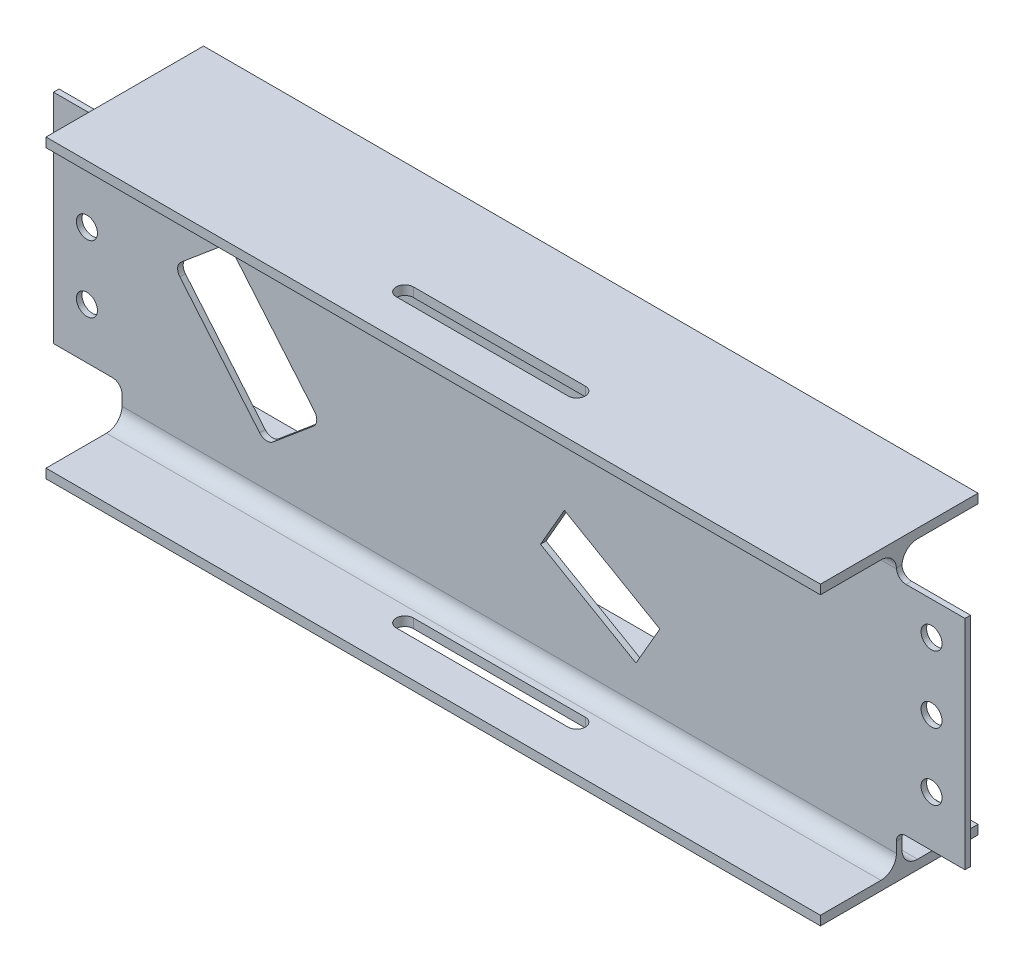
ISO-10303-21;
HEADER;
FILE_DESCRIPTION(('STEP AP214'),'2;1');
FILE_NAME('part.step','',(''),(''),'','','');
FILE_SCHEMA(('AUTOMOTIVE_DESIGN { 1 0 10303 214 1 1 1 1 }'));
ENDSEC;
DATA;
#1=APPLICATION_CONTEXT('core data for automotive mechanical design processes');
#2=APPLICATION_PROTOCOL_DEFINITION('international standard','automotive_design',2000,#1);
#3=PRODUCT_CONTEXT('',#1,'mechanical');
#4=PRODUCT('Part','Part','',(#3));
#5=PRODUCT_RELATED_PRODUCT_CATEGORY('part','',(#4));
#6=PRODUCT_DEFINITION_FORMATION('','',#4);
#7=PRODUCT_DEFINITION_CONTEXT('part definition',#1,'design');
#8=PRODUCT_DEFINITION('design','',#6,#7);
#9=PRODUCT_DEFINITION_SHAPE('','',#8);
#10=(LENGTH_UNIT() NAMED_UNIT(*) SI_UNIT(.MILLI.,.METRE.));
#11=(NAMED_UNIT(*) PLANE_ANGLE_UNIT() SI_UNIT($,.RADIAN.));
#12=(NAMED_UNIT(*) SI_UNIT($,.STERADIAN.) SOLID_ANGLE_UNIT());
#13=UNCERTAINTY_MEASURE_WITH_UNIT(LENGTH_MEASURE(1.E-05),#10,'distance_accuracy_value','');
#14=(GEOMETRIC_REPRESENTATION_CONTEXT(3) GLOBAL_UNCERTAINTY_ASSIGNED_CONTEXT((#13)) GLOBAL_UNIT_ASSIGNED_CONTEXT((#10,
#11,#12)) REPRESENTATION_CONTEXT('',''));
#15=CARTESIAN_POINT('',(0.,0.,0.));
#16=DIRECTION('',(0.,0.,1.));
#17=DIRECTION('',(1.,0.,0.));
#18=AXIS2_PLACEMENT_3D('',#15,#16,#17);
#19=CARTESIAN_POINT('',(1000.,-9.69999999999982,-82.4999999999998));
#20=DIRECTION('',(0.,-1.,0.));
#21=DIRECTION('',(0.,0.,-1.));
#22=AXIS2_PLACEMENT_3D('',#19,#20,#21);
#23=PLANE('',#22);
#24=DIRECTION('',(-1.,0.,0.));
#25=VECTOR('',#24,1.);
#26=CARTESIAN_POINT('',(1000.,-9.70000000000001,-19.1999999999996));
#27=LINE('',#26,#25);
#28=CARTESIAN_POINT('',(905.5,-9.70000000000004,-19.2000000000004));
#29=VERTEX_POINT('',#28);
#30=CARTESIAN_POINT('',(94.4999999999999,-9.70000000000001,-19.2));
#31=VERTEX_POINT('',#30);
#32=EDGE_CURVE('E667',#29,#31,#27,.T.);
#33=ORIENTED_EDGE('',*,*,#32,.T.);
#34=DIRECTION('',(0.,0.,-1.));
#35=VECTOR('',#34,1.);
#36=CARTESIAN_POINT('',(94.5,-9.69999999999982,-82.5000000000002));
#37=LINE('',#36,#35);
#38=CARTESIAN_POINT('',(94.5,-9.69999999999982,-82.5000000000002));
#39=VERTEX_POINT('',#38);
#40=EDGE_CURVE('E582',#31,#39,#37,.T.);
#41=ORIENTED_EDGE('',*,*,#40,.T.);
#42=DIRECTION('',(-1.,0.,0.));
#43=VECTOR('',#42,1.);
#44=CARTESIAN_POINT('',(1000.,-9.69999999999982,-82.4999999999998));
#45=LINE('',#44,#43);
#46=CARTESIAN_POINT('',(905.5,-9.69999999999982,-82.5000000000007));
#47=VERTEX_POINT('',#46);
#48=EDGE_CURVE('E12',#47,#39,#45,.T.);
#49=ORIENTED_EDGE('',*,*,#48,.F.);
#50=DIRECTION('',(0.,0.,-1.));
#51=VECTOR('',#50,1.);
#52=CARTESIAN_POINT('',(905.5,-9.69999999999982,-82.5000000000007));
#53=LINE('',#52,#51);
#54=EDGE_CURVE('E669',#29,#47,#53,.T.);
#55=ORIENTED_EDGE('',*,*,#54,.F.);
#56=EDGE_LOOP('',(#33,#41,#49,#55));
#57=FACE_BOUND('',#56,.T.);
#58=ADVANCED_FACE('F89',(#57),#23,.T.);
#59=CARTESIAN_POINT('',(1000.,0.,-82.4999999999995));
#60=DIRECTION('',(0.,0.,-1.));
#61=DIRECTION('',(0.,1.,0.));
#62=AXIS2_PLACEMENT_3D('',#59,#60,#61);
#63=PLANE('',#62);
#64=ORIENTED_EDGE('',*,*,#48,.T.);
#65=DIRECTION('',(0.,1.,0.));
#66=VECTOR('',#65,1.);
#67=CARTESIAN_POINT('',(94.5,0.,-82.5));
#68=LINE('',#67,#66);
#69=CARTESIAN_POINT('',(94.5,0.,-82.5));
#70=VERTEX_POINT('',#69);
#71=EDGE_CURVE('E585',#39,#70,#68,.T.);
#72=ORIENTED_EDGE('',*,*,#71,.T.);
#73=DIRECTION('',(-1.,0.,0.));
#74=VECTOR('',#73,1.);
#75=CARTESIAN_POINT('',(1000.,0.,-82.4999999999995));
#76=LINE('',#75,#74);
#77=CARTESIAN_POINT('',(905.5,0.,-82.5000000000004));
#78=VERTEX_POINT('',#77);
#79=EDGE_CURVE('E97',#78,#70,#76,.T.);
#80=ORIENTED_EDGE('',*,*,#79,.F.);
#81=DIRECTION('',(0.,1.,0.));
#82=VECTOR('',#81,1.);
#83=CARTESIAN_POINT('',(905.5,0.,-82.5000000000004));
#84=LINE('',#83,#82);
#85=EDGE_CURVE('E797',#47,#78,#84,.T.);
#86=ORIENTED_EDGE('',*,*,#85,.F.);
#87=EDGE_LOOP('',(#64,#72,#80,#86));
#88=FACE_BOUND('',#87,.T.);
#89=ADVANCED_FACE('F657',(#88),#63,.T.);
#90=CARTESIAN_POINT('',(1000.,0.,82.5000000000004));
#91=DIRECTION('',(0.,1.,0.));
#92=DIRECTION('',(0.,0.,1.));
#93=AXIS2_PLACEMENT_3D('',#90,#91,#92);
#94=PLANE('',#93);
#95=CARTESIAN_POINT('',(422.75,0.,35.));
#96=DIRECTION('',(0.,1.,0.));
#97=DIRECTION('',(0.,0.,1.));
#98=AXIS2_PLACEMENT_3D('',#95,#96,#97);
#99=CIRCLE('',#98,9.00000000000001);
#100=CARTESIAN_POINT('',(422.75,0.,26.));
#101=VERTEX_POINT('',#100);
#102=CARTESIAN_POINT('',(422.75,0.,44.));
#103=VERTEX_POINT('',#102);
#104=EDGE_CURVE('E105',#101,#103,#99,.T.);
#105=ORIENTED_EDGE('',*,*,#104,.F.);
#106=DIRECTION('',(-1.,0.,0.));
#107=VECTOR('',#106,1.);
#108=CARTESIAN_POINT('',(422.75,0.,26.));
#109=LINE('',#108,#107);
#110=CARTESIAN_POINT('',(602.75,0.,26.));
#111=VERTEX_POINT('',#110);
#112=EDGE_CURVE('E423',#111,#101,#109,.T.);
#113=ORIENTED_EDGE('',*,*,#112,.F.);
#114=CARTESIAN_POINT('',(602.75,0.,35.));
#115=DIRECTION('',(0.,1.,0.));
#116=DIRECTION('',(0.,0.,1.));
#117=AXIS2_PLACEMENT_3D('',#114,#115,#116);
#118=CIRCLE('',#117,9.00000000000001);
#119=CARTESIAN_POINT('',(602.75,0.,44.));
#120=VERTEX_POINT('',#119);
#121=EDGE_CURVE('E426',#120,#111,#118,.T.);
#122=ORIENTED_EDGE('',*,*,#121,.F.);
#123=DIRECTION('',(1.,0.,0.));
#124=VECTOR('',#123,1.);
#125=CARTESIAN_POINT('',(422.75,0.,44.));
#126=LINE('',#125,#124);
#127=EDGE_CURVE('E432',#103,#120,#126,.T.);
#128=ORIENTED_EDGE('',*,*,#127,.F.);
#129=EDGE_LOOP('',(#105,#113,#122,#128));
#130=FACE_BOUND('',#129,.T.);
#131=ORIENTED_EDGE('',*,*,#79,.T.);
#132=DIRECTION('',(0.,0.,1.));
#133=VECTOR('',#132,1.);
#134=CARTESIAN_POINT('',(94.5,0.,82.5));
#135=LINE('',#134,#133);
#136=CARTESIAN_POINT('',(94.5,0.,82.5));
#137=VERTEX_POINT('',#136);
#138=EDGE_CURVE('E588',#70,#137,#135,.T.);
#139=ORIENTED_EDGE('',*,*,#138,.T.);
#140=DIRECTION('',(-1.,0.,0.));
#141=VECTOR('',#140,1.);
#142=CARTESIAN_POINT('',(1000.,0.,82.5000000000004));
#143=LINE('',#142,#141);
#144=CARTESIAN_POINT('',(905.5,0.,82.4999999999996));
#145=VERTEX_POINT('',#144);
#146=EDGE_CURVE('E716',#145,#137,#143,.T.);
#147=ORIENTED_EDGE('',*,*,#146,.F.);
#148=DIRECTION('',(0.,0.,-1.));
#149=VECTOR('',#148,1.);
#150=CARTESIAN_POINT('',(905.5,0.,-82.5000000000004));
#151=LINE('',#150,#149);
#152=EDGE_CURVE('E794',#145,#78,#151,.T.);
#153=ORIENTED_EDGE('',*,*,#152,.T.);
#154=EDGE_LOOP('',(#131,#139,#147,#153));
#155=FACE_BOUND('',#154,.T.);
#156=ADVANCED_FACE('F662',(#130,#155),#94,.T.);
#157=CARTESIAN_POINT('',(1000.,0.,82.5000000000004));
#158=DIRECTION('',(0.,0.,-1.));
#159=DIRECTION('',(0.,1.,0.));
#160=AXIS2_PLACEMENT_3D('',#157,#158,#159);
#161=PLANE('',#160);
#162=DIRECTION('',(0.,1.,0.));
#163=VECTOR('',#162,1.);
#164=CARTESIAN_POINT('',(94.5,0.,82.5));
#165=LINE('',#164,#163);
#166=CARTESIAN_POINT('',(94.5,-9.69999999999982,82.5000000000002));
#167=VERTEX_POINT('',#166);
#168=EDGE_CURVE('E591',#167,#137,#165,.T.);
#169=ORIENTED_EDGE('',*,*,#168,.F.);
#170=DIRECTION('',(-1.,0.,0.));
#171=VECTOR('',#170,1.);
#172=CARTESIAN_POINT('',(1000.,-9.69999999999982,82.5000000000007));
#173=LINE('',#172,#171);
#174=CARTESIAN_POINT('',(905.5,-9.69999999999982,82.4999999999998));
#175=VERTEX_POINT('',#174);
#176=EDGE_CURVE('E713',#175,#167,#173,.T.);
#177=ORIENTED_EDGE('',*,*,#176,.F.);
#178=DIRECTION('',(0.,1.,0.));
#179=VECTOR('',#178,1.);
#180=CARTESIAN_POINT('',(905.5,0.,82.4999999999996));
#181=LINE('',#180,#179);
#182=EDGE_CURVE('E791',#175,#145,#181,.T.);
#183=ORIENTED_EDGE('',*,*,#182,.T.);
#184=ORIENTED_EDGE('',*,*,#146,.T.);
#185=EDGE_LOOP('',(#169,#177,#183,#184));
#186=FACE_BOUND('',#185,.T.);
#187=ADVANCED_FACE('F899',(#186),#161,.F.);
#188=CARTESIAN_POINT('',(1000.,-9.69999999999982,82.5000000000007));
#189=DIRECTION('',(0.,1.,0.));
#190=DIRECTION('',(0.,0.,1.));
#191=AXIS2_PLACEMENT_3D('',#188,#189,#190);
#192=PLANE('',#191);
#193=DIRECTION('',(-1.,0.,0.));
#194=VECTOR('',#193,1.);
#195=CARTESIAN_POINT('',(1000.,-9.70000000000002,26.));
#196=LINE('',#195,#194);
#197=CARTESIAN_POINT('',(602.75,-9.69999999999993,26.));
#198=VERTEX_POINT('',#197);
#199=CARTESIAN_POINT('',(422.75,-9.70000000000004,26.));
#200=VERTEX_POINT('',#199);
#201=EDGE_CURVE('E456',#198,#200,#196,.T.);
#202=ORIENTED_EDGE('',*,*,#201,.T.);
#203=CARTESIAN_POINT('',(422.75,-9.69999999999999,35.));
#204=DIRECTION('',(0.,1.,0.));
#205=DIRECTION('',(0.,0.,1.));
#206=AXIS2_PLACEMENT_3D('',#203,#204,#205);
#207=CIRCLE('',#206,9.00000000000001);
#208=CARTESIAN_POINT('',(422.75,-9.69999999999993,44.));
#209=VERTEX_POINT('',#208);
#210=EDGE_CURVE('E460',#200,#209,#207,.T.);
#211=ORIENTED_EDGE('',*,*,#210,.T.);
#212=DIRECTION('',(1.,0.,0.));
#213=VECTOR('',#212,1.);
#214=CARTESIAN_POINT('',(1000.,-9.69999999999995,44.));
#215=LINE('',#214,#213);
#216=CARTESIAN_POINT('',(602.75,-9.69999999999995,44.));
#217=VERTEX_POINT('',#216);
#218=EDGE_CURVE('E446',#209,#217,#215,.T.);
#219=ORIENTED_EDGE('',*,*,#218,.T.);
#220=CARTESIAN_POINT('',(602.75,-9.69999999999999,35.));
#221=DIRECTION('',(0.,1.,0.));
#222=DIRECTION('',(0.,0.,1.));
#223=AXIS2_PLACEMENT_3D('',#220,#221,#222);
#224=CIRCLE('',#223,9.00000000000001);
#225=EDGE_CURVE('E451',#217,#198,#224,.T.);
#226=ORIENTED_EDGE('',*,*,#225,.T.);
#227=EDGE_LOOP('',(#202,#211,#219,#226));
#228=FACE_BOUND('',#227,.T.);
#229=DIRECTION('',(0.,0.,1.));
#230=VECTOR('',#229,1.);
#231=CARTESIAN_POINT('',(94.5,-9.69999999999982,82.5000000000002));
#232=LINE('',#231,#230);
#233=CARTESIAN_POINT('',(94.5,-9.70000000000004,19.2));
#234=VERTEX_POINT('',#233);
#235=EDGE_CURVE('E593',#234,#167,#232,.T.);
#236=ORIENTED_EDGE('',*,*,#235,.F.);
#237=DIRECTION('',(-1.,0.,0.));
#238=VECTOR('',#237,1.);
#239=CARTESIAN_POINT('',(1000.,-9.70000000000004,19.2000000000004));
#240=LINE('',#239,#238);
#241=CARTESIAN_POINT('',(905.5,-9.70000000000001,19.1999999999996));
#242=VERTEX_POINT('',#241);
#243=EDGE_CURVE('E710',#242,#234,#240,.T.);
#244=ORIENTED_EDGE('',*,*,#243,.F.);
#245=DIRECTION('',(0.,0.,1.));
#246=VECTOR('',#245,1.);
#247=CARTESIAN_POINT('',(905.5,-9.69999999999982,82.4999999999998));
#248=LINE('',#247,#246);
#249=EDGE_CURVE('E788',#242,#175,#248,.T.);
#250=ORIENTED_EDGE('',*,*,#249,.T.);
#251=ORIENTED_EDGE('',*,*,#176,.T.);
#252=EDGE_LOOP('',(#236,#244,#250,#251));
#253=FACE_BOUND('',#252,.T.);
#254=ADVANCED_FACE('F894',(#228,#253),#192,.F.);
#255=CARTESIAN_POINT('',(1000.,-26.,19.2000000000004));
#256=DIRECTION('',(-1.,0.,0.));
#257=DIRECTION('',(0.,0.,1.));
#258=AXIS2_PLACEMENT_3D('',#255,#256,#257);
#259=CYLINDRICAL_SURFACE('',#258,16.3);
#260=CARTESIAN_POINT('',(94.4498743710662,-26.,2.90000000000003));
#261=CARTESIAN_POINT('',(94.4665855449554,-25.833594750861,2.8999883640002));
#262=CARTESIAN_POINT('',(94.4791182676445,-25.6670587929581,2.902541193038));
#263=CARTESIAN_POINT('',(94.4958268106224,-25.3337254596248,2.91277578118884));
#264=CARTESIAN_POINT('',(94.5000026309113,-25.1669280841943,2.92045754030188));
#265=CARTESIAN_POINT('',(94.5,-24.9999999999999,2.93070376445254));
#266=B_SPLINE_CURVE_WITH_KNOTS('',3,(#260,#261,#262,#263,#264,#265),.UNSPECIFIED.,.F.,.F.,(4,2,
4),(0.,0.50107913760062,1.00215827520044),.UNSPECIFIED.);
#267=CARTESIAN_POINT('',(94.4498743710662,-26.,2.90000000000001));
#268=VERTEX_POINT('',#267);
#269=CARTESIAN_POINT('',(94.5,-24.9999999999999,2.93070376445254));
#270=VERTEX_POINT('',#269);
#271=EDGE_CURVE('E602',#268,#270,#266,.T.);
#272=ORIENTED_EDGE('',*,*,#271,.F.);
#273=DIRECTION('',(-1.,0.,0.));
#274=VECTOR('',#273,1.);
#275=CARTESIAN_POINT('',(1000.,-26.,2.90000000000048));
#276=LINE('',#275,#274);
#277=CARTESIAN_POINT('',(905.550125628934,-26.,2.89999999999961));
#278=VERTEX_POINT('',#277);
#279=EDGE_CURVE('E707',#278,#268,#276,.T.);
#280=ORIENTED_EDGE('',*,*,#279,.F.);
#281=CARTESIAN_POINT('',(905.550125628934,-26.,2.89999999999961));
#282=CARTESIAN_POINT('',(905.533414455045,-25.833594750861,2.89998836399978));
#283=CARTESIAN_POINT('',(905.520881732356,-25.6670587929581,2.90254119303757));
#284=CARTESIAN_POINT('',(905.504173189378,-25.3337254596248,2.91277578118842));
#285=CARTESIAN_POINT('',(905.499997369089,-25.1669280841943,2.92045754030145));
#286=CARTESIAN_POINT('',(905.5,-24.9999999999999,2.93070376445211));
#287=B_SPLINE_CURVE_WITH_KNOTS('',3,(#281,#282,#283,#284,#285,#286),.UNSPECIFIED.,.F.,.F.,(4,2,
4),(0.,0.501079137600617,1.00215827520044),.UNSPECIFIED.);
#288=CARTESIAN_POINT('',(905.5,-24.9999999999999,2.93070376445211));
#289=VERTEX_POINT('',#288);
#290=EDGE_CURVE('E832',#278,#289,#287,.T.);
#291=ORIENTED_EDGE('',*,*,#290,.T.);
#292=CARTESIAN_POINT('',(905.5,-26.,19.1999999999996));
#293=DIRECTION('',(1.,0.,0.));
#294=DIRECTION('',(0.,-1.,0.));
#295=AXIS2_PLACEMENT_3D('',#292,#293,#294);
#296=CIRCLE('',#295,16.3);
#297=EDGE_CURVE('E840',#289,#242,#296,.T.);
#298=ORIENTED_EDGE('',*,*,#297,.T.);
#299=ORIENTED_EDGE('',*,*,#243,.T.);
#300=CARTESIAN_POINT('',(94.5,-26.,19.2));
#301=DIRECTION('',(-1.,0.,0.));
#302=DIRECTION('',(0.,-1.,0.));
#303=AXIS2_PLACEMENT_3D('',#300,#301,#302);
#304=CIRCLE('',#303,16.3);
#305=EDGE_CURVE('E595',#270,#234,#304,.F.);
#306=ORIENTED_EDGE('',*,*,#305,.F.);
#307=EDGE_LOOP('',(#272,#280,#291,#298,#299,#306));
#308=FACE_BOUND('',#307,.T.);
#309=ADVANCED_FACE('F887',(#308),#259,.F.);
#310=CARTESIAN_POINT('',(1000.,-284.,19.2000000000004));
#311=DIRECTION('',(-1.,0.,0.));
#312=DIRECTION('',(0.,0.,1.));
#313=AXIS2_PLACEMENT_3D('',#310,#311,#312);
#314=CYLINDRICAL_SURFACE('',#313,16.3);
#315=DIRECTION('',(-1.,0.,0.));
#316=VECTOR('',#315,1.);
#317=CARTESIAN_POINT('',(1000.,-284.,2.90000000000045));
#318=LINE('',#317,#316);
#319=CARTESIAN_POINT('',(905.5,-284.,2.89999999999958));
#320=VERTEX_POINT('',#319);
#321=CARTESIAN_POINT('',(94.5,-284.,2.90000000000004));
#322=VERTEX_POINT('',#321);
#323=EDGE_CURVE('E704',#320,#322,#318,.T.);
#324=ORIENTED_EDGE('',*,*,#323,.T.);
#325=CARTESIAN_POINT('',(94.5,-284.,19.2));
#326=DIRECTION('',(-1.,0.,0.));
#327=DIRECTION('',(0.,-1.,0.));
#328=AXIS2_PLACEMENT_3D('',#325,#326,#327);
#329=CIRCLE('',#328,16.3);
#330=CARTESIAN_POINT('',(94.5,-300.3,19.2));
#331=VERTEX_POINT('',#330);
#332=EDGE_CURVE('E925',#322,#331,#329,.T.);
#333=ORIENTED_EDGE('',*,*,#332,.T.);
#334=DIRECTION('',(-1.,0.,0.));
#335=VECTOR('',#334,1.);
#336=CARTESIAN_POINT('',(1000.,-300.3,19.2000000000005));
#337=LINE('',#336,#335);
#338=CARTESIAN_POINT('',(905.5,-300.3,19.1999999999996));
#339=VERTEX_POINT('',#338);
#340=EDGE_CURVE('E701',#339,#331,#337,.T.);
#341=ORIENTED_EDGE('',*,*,#340,.F.);
#342=CARTESIAN_POINT('',(905.5,-284.,19.1999999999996));
#343=DIRECTION('',(1.,0.,0.));
#344=DIRECTION('',(0.,-1.,0.));
#345=AXIS2_PLACEMENT_3D('',#342,#343,#344);
#346=CIRCLE('',#345,16.3);
#347=EDGE_CURVE('E814',#320,#339,#346,.F.);
#348=ORIENTED_EDGE('',*,*,#347,.F.);
#349=EDGE_LOOP('',(#324,#333,#341,#348));
#350=FACE_BOUND('',#349,.T.);
#351=ADVANCED_FACE('F976',(#350),#314,.F.);
#352=CARTESIAN_POINT('',(1000.,-300.3,82.5000000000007));
#353=DIRECTION('',(0.,1.,0.));
#354=DIRECTION('',(0.,0.,1.));
#355=AXIS2_PLACEMENT_3D('',#352,#353,#354);
#356=PLANE('',#355);
#357=CARTESIAN_POINT('',(422.75,-300.3,35.));
#358=DIRECTION('',(0.,1.,0.));
#359=DIRECTION('',(0.,0.,1.));
#360=AXIS2_PLACEMENT_3D('',#357,#358,#359);
#361=CIRCLE('',#360,9.00000000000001);
#362=CARTESIAN_POINT('',(422.75,-300.3,26.));
#363=VERTEX_POINT('',#362);
#364=CARTESIAN_POINT('',(422.75,-300.3,44.));
#365=VERTEX_POINT('',#364);
#366=EDGE_CURVE('E404',#363,#365,#361,.T.);
#367=ORIENTED_EDGE('',*,*,#366,.F.);
#368=DIRECTION('',(-1.,0.,0.));
#369=VECTOR('',#368,1.);
#370=CARTESIAN_POINT('',(1000.,-300.3,26.));
#371=LINE('',#370,#369);
#372=CARTESIAN_POINT('',(602.75,-300.3,26.));
#373=VERTEX_POINT('',#372);
#374=EDGE_CURVE('E454',#373,#363,#371,.T.);
#375=ORIENTED_EDGE('',*,*,#374,.F.);
#376=CARTESIAN_POINT('',(602.75,-300.3,35.));
#377=DIRECTION('',(0.,1.,0.));
#378=DIRECTION('',(0.,0.,1.));
#379=AXIS2_PLACEMENT_3D('',#376,#377,#378);
#380=CIRCLE('',#379,9.00000000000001);
#381=CARTESIAN_POINT('',(602.75,-300.3,44.));
#382=VERTEX_POINT('',#381);
#383=EDGE_CURVE('E449',#382,#373,#380,.T.);
#384=ORIENTED_EDGE('',*,*,#383,.F.);
#385=DIRECTION('',(1.,0.,0.));
#386=VECTOR('',#385,1.);
#387=CARTESIAN_POINT('',(1000.,-300.3,44.));
#388=LINE('',#387,#386);
#389=EDGE_CURVE('E438',#365,#382,#388,.T.);
#390=ORIENTED_EDGE('',*,*,#389,.F.);
#391=EDGE_LOOP('',(#367,#375,#384,#390));
#392=FACE_BOUND('',#391,.T.);
#393=ORIENTED_EDGE('',*,*,#340,.T.);
#394=DIRECTION('',(0.,0.,1.));
#395=VECTOR('',#394,1.);
#396=CARTESIAN_POINT('',(94.5,-300.3,82.5000000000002));
#397=LINE('',#396,#395);
#398=CARTESIAN_POINT('',(94.5,-300.3,82.5000000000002));
#399=VERTEX_POINT('',#398);
#400=EDGE_CURVE('E928',#331,#399,#397,.T.);
#401=ORIENTED_EDGE('',*,*,#400,.T.);
#402=DIRECTION('',(-1.,0.,0.));
#403=VECTOR('',#402,1.);
#404=CARTESIAN_POINT('',(1000.,-300.3,82.5000000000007));
#405=LINE('',#404,#403);
#406=CARTESIAN_POINT('',(905.5,-300.3,82.4999999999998));
#407=VERTEX_POINT('',#406);
#408=EDGE_CURVE('E698',#407,#399,#405,.T.);
#409=ORIENTED_EDGE('',*,*,#408,.F.);
#410=DIRECTION('',(0.,0.,1.));
#411=VECTOR('',#410,1.);
#412=CARTESIAN_POINT('',(905.5,-300.3,82.4999999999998));
#413=LINE('',#412,#411);
#414=EDGE_CURVE('E966',#339,#407,#413,.T.);
#415=ORIENTED_EDGE('',*,*,#414,.F.);
#416=EDGE_LOOP('',(#393,#401,#409,#415));
#417=FACE_BOUND('',#416,.T.);
#418=ADVANCED_FACE('F975',(#392,#417),#356,.T.);
#419=CARTESIAN_POINT('',(1000.,-310.,82.5000000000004));
#420=DIRECTION('',(0.,0.,1.));
#421=DIRECTION('',(0.,-1.,0.));
#422=AXIS2_PLACEMENT_3D('',#419,#420,#421);
#423=PLANE('',#422);
#424=ORIENTED_EDGE('',*,*,#408,.T.);
#425=DIRECTION('',(0.,-1.,0.));
#426=VECTOR('',#425,1.);
#427=CARTESIAN_POINT('',(94.5,-310.,82.5));
#428=LINE('',#427,#426);
#429=CARTESIAN_POINT('',(94.5,-310.,82.5));
#430=VERTEX_POINT('',#429);
#431=EDGE_CURVE('E931',#399,#430,#428,.T.);
#432=ORIENTED_EDGE('',*,*,#431,.T.);
#433=DIRECTION('',(-1.,0.,0.));
#434=VECTOR('',#433,1.);
#435=CARTESIAN_POINT('',(1000.,-310.,82.5000000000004));
#436=LINE('',#435,#434);
#437=CARTESIAN_POINT('',(905.5,-310.,82.4999999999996));
#438=VERTEX_POINT('',#437);
#439=EDGE_CURVE('E695',#438,#430,#436,.T.);
#440=ORIENTED_EDGE('',*,*,#439,.F.);
#441=DIRECTION('',(0.,-1.,0.));
#442=VECTOR('',#441,1.);
#443=CARTESIAN_POINT('',(905.5,-310.,82.4999999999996));
#444=LINE('',#443,#442);
#445=EDGE_CURVE('E965',#407,#438,#444,.T.);
#446=ORIENTED_EDGE('',*,*,#445,.F.);
#447=EDGE_LOOP('',(#424,#432,#440,#446));
#448=FACE_BOUND('',#447,.T.);
#449=ADVANCED_FACE('F978',(#448),#423,.T.);
#450=CARTESIAN_POINT('',(1000.,-310.,82.5000000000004));
#451=DIRECTION('',(0.,1.,0.));
#452=DIRECTION('',(0.,0.,1.));
#453=AXIS2_PLACEMENT_3D('',#450,#451,#452);
#454=PLANE('',#453);
#455=DIRECTION('',(-1.,0.,0.));
#456=VECTOR('',#455,1.);
#457=CARTESIAN_POINT('',(422.75,-310.,26.));
#458=LINE('',#457,#456);
#459=CARTESIAN_POINT('',(602.75,-310.,26.));
#460=VERTEX_POINT('',#459);
#461=CARTESIAN_POINT('',(422.75,-310.,26.));
#462=VERTEX_POINT('',#461);
#463=EDGE_CURVE('E422',#460,#462,#458,.T.);
#464=ORIENTED_EDGE('',*,*,#463,.T.);
#465=CARTESIAN_POINT('',(422.75,-310.,35.));
#466=DIRECTION('',(0.,1.,0.));
#467=DIRECTION('',(0.,0.,1.));
#468=AXIS2_PLACEMENT_3D('',#465,#466,#467);
#469=CIRCLE('',#468,9.00000000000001);
#470=CARTESIAN_POINT('',(422.75,-310.,44.));
#471=VERTEX_POINT('',#470);
#472=EDGE_CURVE('E401',#462,#471,#469,.T.);
#473=ORIENTED_EDGE('',*,*,#472,.T.);
#474=DIRECTION('',(1.,0.,0.));
#475=VECTOR('',#474,1.);
#476=CARTESIAN_POINT('',(422.75,-310.,44.));
#477=LINE('',#476,#475);
#478=CARTESIAN_POINT('',(602.75,-310.,44.));
#479=VERTEX_POINT('',#478);
#480=EDGE_CURVE('E411',#471,#479,#477,.T.);
#481=ORIENTED_EDGE('',*,*,#480,.T.);
#482=CARTESIAN_POINT('',(602.75,-310.,35.));
#483=DIRECTION('',(0.,1.,0.));
#484=DIRECTION('',(0.,0.,1.));
#485=AXIS2_PLACEMENT_3D('',#482,#483,#484);
#486=CIRCLE('',#485,9.00000000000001);
#487=EDGE_CURVE('E417',#479,#460,#486,.T.);
#488=ORIENTED_EDGE('',*,*,#487,.T.);
#489=EDGE_LOOP('',(#464,#473,#481,#488));
#490=FACE_BOUND('',#489,.T.);
#491=DIRECTION('',(0.,0.,1.));
#492=VECTOR('',#491,1.);
#493=CARTESIAN_POINT('',(94.5,-310.,82.5));
#494=LINE('',#493,#492);
#495=CARTESIAN_POINT('',(94.5,-310.,-82.5));
#496=VERTEX_POINT('',#495);
#497=EDGE_CURVE('E934',#496,#430,#494,.T.);
#498=ORIENTED_EDGE('',*,*,#497,.F.);
#499=DIRECTION('',(-1.,0.,0.));
#500=VECTOR('',#499,1.);
#501=CARTESIAN_POINT('',(1000.,-310.,-82.4999999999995));
#502=LINE('',#501,#500);
#503=CARTESIAN_POINT('',(905.5,-310.,-82.5000000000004));
#504=VERTEX_POINT('',#503);
#505=EDGE_CURVE('E692',#504,#496,#502,.T.);
#506=ORIENTED_EDGE('',*,*,#505,.F.);
#507=DIRECTION('',(0.,0.,-1.));
#508=VECTOR('',#507,1.);
#509=CARTESIAN_POINT('',(905.5,-310.,-82.5000000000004));
#510=LINE('',#509,#508);
#511=EDGE_CURVE('E963',#438,#504,#510,.T.);
#512=ORIENTED_EDGE('',*,*,#511,.F.);
#513=ORIENTED_EDGE('',*,*,#439,.T.);
#514=EDGE_LOOP('',(#498,#506,#512,#513));
#515=FACE_BOUND('',#514,.T.);
#516=ADVANCED_FACE('F419',(#490,#515),#454,.F.);
#517=CARTESIAN_POINT('',(1000.,-310.,-82.4999999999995));
#518=DIRECTION('',(0.,0.,1.));
#519=DIRECTION('',(0.,-1.,0.));
#520=AXIS2_PLACEMENT_3D('',#517,#518,#519);
#521=PLANE('',#520);
#522=DIRECTION('',(0.,-1.,0.));
#523=VECTOR('',#522,1.);
#524=CARTESIAN_POINT('',(94.5,-310.,-82.5));
#525=LINE('',#524,#523);
#526=CARTESIAN_POINT('',(94.5,-300.3,-82.5000000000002));
#527=VERTEX_POINT('',#526);
#528=EDGE_CURVE('E936',#527,#496,#525,.T.);
#529=ORIENTED_EDGE('',*,*,#528,.F.);
#530=DIRECTION('',(-1.,0.,0.));
#531=VECTOR('',#530,1.);
#532=CARTESIAN_POINT('',(1000.,-300.3,-82.4999999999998));
#533=LINE('',#532,#531);
#534=CARTESIAN_POINT('',(905.5,-300.3,-82.5000000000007));
#535=VERTEX_POINT('',#534);
#536=EDGE_CURVE('E689',#535,#527,#533,.T.);
#537=ORIENTED_EDGE('',*,*,#536,.F.);
#538=DIRECTION('',(0.,-1.,0.));
#539=VECTOR('',#538,1.);
#540=CARTESIAN_POINT('',(905.5,-310.,-82.5000000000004));
#541=LINE('',#540,#539);
#542=EDGE_CURVE('E958',#535,#504,#541,.T.);
#543=ORIENTED_EDGE('',*,*,#542,.T.);
#544=ORIENTED_EDGE('',*,*,#505,.T.);
#545=EDGE_LOOP('',(#529,#537,#543,#544));
#546=FACE_BOUND('',#545,.T.);
#547=ADVANCED_FACE('F984',(#546),#521,.F.);
#548=CARTESIAN_POINT('',(1000.,-300.3,-82.4999999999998));
#549=DIRECTION('',(0.,-1.,0.));
#550=DIRECTION('',(0.,0.,-1.));
#551=AXIS2_PLACEMENT_3D('',#548,#549,#550);
#552=PLANE('',#551);
#553=DIRECTION('',(0.,0.,-1.));
#554=VECTOR('',#553,1.);
#555=CARTESIAN_POINT('',(94.5,-300.3,-82.5000000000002));
#556=LINE('',#555,#554);
#557=CARTESIAN_POINT('',(94.5,-300.3,-19.2));
#558=VERTEX_POINT('',#557);
#559=EDGE_CURVE('E937',#558,#527,#556,.T.);
#560=ORIENTED_EDGE('',*,*,#559,.F.);
#561=DIRECTION('',(-1.,0.,0.));
#562=VECTOR('',#561,1.);
#563=CARTESIAN_POINT('',(1000.,-300.3,-19.1999999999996));
#564=LINE('',#563,#562);
#565=CARTESIAN_POINT('',(905.5,-300.3,-19.2000000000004));
#566=VERTEX_POINT('',#565);
#567=EDGE_CURVE('E686',#566,#558,#564,.T.);
#568=ORIENTED_EDGE('',*,*,#567,.F.);
#569=DIRECTION('',(0.,0.,-1.));
#570=VECTOR('',#569,1.);
#571=CARTESIAN_POINT('',(905.5,-300.3,-82.5000000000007));
#572=LINE('',#571,#570);
#573=EDGE_CURVE('E956',#566,#535,#572,.T.);
#574=ORIENTED_EDGE('',*,*,#573,.T.);
#575=ORIENTED_EDGE('',*,*,#536,.T.);
#576=EDGE_LOOP('',(#560,#568,#574,#575));
#577=FACE_BOUND('',#576,.T.);
#578=ADVANCED_FACE('F947',(#577),#552,.F.);
#579=CARTESIAN_POINT('',(1000.,-284.,-19.1999999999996));
#580=DIRECTION('',(-1.,0.,0.));
#581=DIRECTION('',(0.,0.,1.));
#582=AXIS2_PLACEMENT_3D('',#579,#580,#581);
#583=CYLINDRICAL_SURFACE('',#582,16.3);
#584=CARTESIAN_POINT('',(94.5,-284.,-19.2));
#585=DIRECTION('',(-1.,0.,0.));
#586=DIRECTION('',(0.,-1.,0.));
#587=AXIS2_PLACEMENT_3D('',#584,#585,#586);
#588=CIRCLE('',#587,16.3);
#589=CARTESIAN_POINT('',(94.5,-284.,-2.90000000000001));
#590=VERTEX_POINT('',#589);
#591=EDGE_CURVE('E610',#590,#558,#588,.F.);
#592=ORIENTED_EDGE('',*,*,#591,.F.);
#593=DIRECTION('',(-1.,0.,0.));
#594=VECTOR('',#593,1.);
#595=CARTESIAN_POINT('',(1000.,-284.,-2.8999999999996));
#596=LINE('',#595,#594);
#597=CARTESIAN_POINT('',(905.5,-284.,-2.90000000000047));
#598=VERTEX_POINT('',#597);
#599=EDGE_CURVE('E677',#598,#590,#596,.T.);
#600=ORIENTED_EDGE('',*,*,#599,.F.);
#601=CARTESIAN_POINT('',(905.5,-284.,-19.2000000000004));
#602=DIRECTION('',(1.,0.,0.));
#603=DIRECTION('',(0.,-1.,0.));
#604=AXIS2_PLACEMENT_3D('',#601,#602,#603);
#605=CIRCLE('',#604,16.3);
#606=EDGE_CURVE('E952',#598,#566,#605,.T.);
#607=ORIENTED_EDGE('',*,*,#606,.T.);
#608=ORIENTED_EDGE('',*,*,#567,.T.);
#609=EDGE_LOOP('',(#592,#600,#607,#608));
#610=FACE_BOUND('',#609,.T.);
#611=ADVANCED_FACE('F951',(#610),#583,.F.);
#612=CARTESIAN_POINT('',(1000.,-26.,-19.1999999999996));
#613=DIRECTION('',(-1.,0.,0.));
#614=DIRECTION('',(0.,0.,1.));
#615=AXIS2_PLACEMENT_3D('',#612,#613,#614);
#616=CYLINDRICAL_SURFACE('',#615,16.3);
#617=DIRECTION('',(-1.,0.,0.));
#618=VECTOR('',#617,1.);
#619=CARTESIAN_POINT('',(1000.,-26.,-2.89999999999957));
#620=LINE('',#619,#618);
#621=CARTESIAN_POINT('',(905.550125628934,-26.,-2.90000000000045));
#622=VERTEX_POINT('',#621);
#623=CARTESIAN_POINT('',(94.4498743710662,-26.,-2.90000000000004));
#624=VERTEX_POINT('',#623);
#625=EDGE_CURVE('E673',#622,#624,#620,.T.);
#626=ORIENTED_EDGE('',*,*,#625,.T.);
#627=CARTESIAN_POINT('',(94.4498743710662,-26.,-2.90000000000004));
#628=CARTESIAN_POINT('',(94.4665855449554,-25.833594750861,-2.89998836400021));
#629=CARTESIAN_POINT('',(94.4791182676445,-25.6670587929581,-2.902541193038));
#630=CARTESIAN_POINT('',(94.4958268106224,-25.3337254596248,-2.91277578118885));
#631=CARTESIAN_POINT('',(94.5000026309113,-25.1669280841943,-2.92045754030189));
#632=CARTESIAN_POINT('',(94.5,-24.9999999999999,-2.93070376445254));
#633=B_SPLINE_CURVE_WITH_KNOTS('',3,(#627,#628,#629,#630,#631,#632),.UNSPECIFIED.,.F.,.F.,(4,2,
4),(0.,0.501079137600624,1.00215827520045),.UNSPECIFIED.);
#634=CARTESIAN_POINT('',(94.5,-24.9999999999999,-2.93070376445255));
#635=VERTEX_POINT('',#634);
#636=EDGE_CURVE('E628',#624,#635,#633,.T.);
#637=ORIENTED_EDGE('',*,*,#636,.T.);
#638=CARTESIAN_POINT('',(94.5,-26.,-19.2));
#639=DIRECTION('',(-1.,0.,0.));
#640=DIRECTION('',(0.,-1.,0.));
#641=AXIS2_PLACEMENT_3D('',#638,#639,#640);
#642=CIRCLE('',#641,16.3);
#643=EDGE_CURVE('E636',#635,#31,#642,.T.);
#644=ORIENTED_EDGE('',*,*,#643,.T.);
#645=ORIENTED_EDGE('',*,*,#32,.F.);
#646=CARTESIAN_POINT('',(905.5,-26.,-19.2000000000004));
#647=DIRECTION('',(1.,0.,0.));
#648=DIRECTION('',(0.,-1.,0.));
#649=AXIS2_PLACEMENT_3D('',#646,#647,#648);
#650=CIRCLE('',#649,16.3);
#651=CARTESIAN_POINT('',(905.5,-24.9999999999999,-2.93070376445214));
#652=VERTEX_POINT('',#651);
#653=EDGE_CURVE('E800',#652,#29,#650,.F.);
#654=ORIENTED_EDGE('',*,*,#653,.F.);
#655=CARTESIAN_POINT('',(905.550125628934,-26.,-2.90000000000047));
#656=CARTESIAN_POINT('',(905.533414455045,-25.833594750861,-2.89998836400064));
#657=CARTESIAN_POINT('',(905.520881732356,-25.6670587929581,-2.90254119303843));
#658=CARTESIAN_POINT('',(905.504173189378,-25.3337254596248,-2.91277578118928));
#659=CARTESIAN_POINT('',(905.499997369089,-25.1669280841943,-2.92045754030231));
#660=CARTESIAN_POINT('',(905.5,-24.9999999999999,-2.93070376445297));
#661=B_SPLINE_CURVE_WITH_KNOTS('',3,(#655,#656,#657,#658,#659,#660),.UNSPECIFIED.,.F.,.F.,(4,2,
4),(0.,0.501079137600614,1.00215827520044),.UNSPECIFIED.);
#662=EDGE_CURVE('E807',#622,#652,#661,.T.);
#663=ORIENTED_EDGE('',*,*,#662,.F.);
#664=EDGE_LOOP('',(#626,#637,#644,#645,#654,#663));
#665=FACE_BOUND('',#664,.T.);
#666=ADVANCED_FACE('F752',(#665),#616,.F.);
#667=CARTESIAN_POINT('',(1000.,-26.,2.90000000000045));
#668=DIRECTION('',(0.,0.,-1.));
#669=DIRECTION('',(-1.,0.,0.));
#670=AXIS2_PLACEMENT_3D('',#667,#668,#669);
#671=PLANE('',#670);
#672=DIRECTION('',(-0.766044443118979,-0.642787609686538,0.));
#673=VECTOR('',#672,1.);
#674=CARTESIAN_POINT('',(795.268736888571,217.989218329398,2.90000000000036));
#675=LINE('',#674,#673);
#676=CARTESIAN_POINT('',(294.872709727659,-201.892903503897,2.90000000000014));
#677=VERTEX_POINT('',#676);
#678=CARTESIAN_POINT('',(252.740265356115,-237.246222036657,2.90000000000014));
#679=VERTEX_POINT('',#678);
#680=EDGE_CURVE('E521',#677,#679,#675,.T.);
#681=ORIENTED_EDGE('',*,*,#680,.T.);
#682=CARTESIAN_POINT('',(246.31238925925,-229.585777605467,2.90000000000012));
#683=DIRECTION('',(0.,0.,-1.));
#684=DIRECTION('',(-1.,0.,0.));
#685=AXIS2_PLACEMENT_3D('',#682,#683,#684);
#686=CIRCLE('',#685,10.);
#687=CARTESIAN_POINT('',(238.65194482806,-236.013653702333,2.9000000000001));
#688=VERTEX_POINT('',#687);
#689=EDGE_CURVE('E524',#679,#688,#686,.T.);
#690=ORIENTED_EDGE('',*,*,#689,.T.);
#691=DIRECTION('',(-0.642787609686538,0.76604444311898,0.));
#692=VECTOR('',#691,1.);
#693=CARTESIAN_POINT('',(449.811084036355,-487.66331646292,2.90000000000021));
#694=LINE('',#693,#692);
#695=CARTESIAN_POINT('',(155.08955556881,-136.427876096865,2.90000000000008));
#696=VERTEX_POINT('',#695);
#697=EDGE_CURVE('E489',#688,#696,#694,.T.);
#698=ORIENTED_EDGE('',*,*,#697,.T.);
#699=CARTESIAN_POINT('',(162.75,-130.,2.90000000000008));
#700=DIRECTION('',(0.,0.,-1.));
#701=DIRECTION('',(-1.,0.,0.));
#702=AXIS2_PLACEMENT_3D('',#699,#700,#701);
#703=CIRCLE('',#702,9.99999999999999);
#704=CARTESIAN_POINT('',(156.322123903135,-122.33955556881,2.90000000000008));
#705=VERTEX_POINT('',#704);
#706=EDGE_CURVE('E506',#696,#705,#703,.T.);
#707=ORIENTED_EDGE('',*,*,#706,.T.);
#708=DIRECTION('',(0.766044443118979,0.642787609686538,0.));
#709=VECTOR('',#708,1.);
#710=CARTESIAN_POINT('',(698.85059543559,332.895884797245,2.90000000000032));
#711=LINE('',#710,#709);
#712=CARTESIAN_POINT('',(198.454568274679,-86.9862370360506,2.90000000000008));
#713=VERTEX_POINT('',#712);
#714=EDGE_CURVE('E509',#705,#713,#711,.T.);
#715=ORIENTED_EDGE('',*,*,#714,.T.);
#716=CARTESIAN_POINT('',(204.882444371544,-94.6466814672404,2.90000000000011));
#717=DIRECTION('',(0.,0.,-1.));
#718=DIRECTION('',(-1.,0.,0.));
#719=AXIS2_PLACEMENT_3D('',#716,#717,#718);
#720=CIRCLE('',#719,9.99999999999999);
#721=CARTESIAN_POINT('',(212.542888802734,-88.218805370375,2.90000000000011));
#722=VERTEX_POINT('',#721);
#723=EDGE_CURVE('E512',#713,#722,#720,.T.);
#724=ORIENTED_EDGE('',*,*,#723,.T.);
#725=DIRECTION('',(0.642787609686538,-0.766044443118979,0.));
#726=VECTOR('',#725,1.);
#727=CARTESIAN_POINT('',(507.264417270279,-439.45424573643,2.90000000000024));
#728=LINE('',#727,#726);
#729=CARTESIAN_POINT('',(296.105278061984,-187.804582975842,2.90000000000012));
#730=VERTEX_POINT('',#729);
#731=EDGE_CURVE('E515',#722,#730,#728,.T.);
#732=ORIENTED_EDGE('',*,*,#731,.T.);
#733=CARTESIAN_POINT('',(288.444833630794,-194.232459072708,2.90000000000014));
#734=DIRECTION('',(0.,0.,-1.));
#735=DIRECTION('',(-1.,0.,0.));
#736=AXIS2_PLACEMENT_3D('',#733,#734,#735);
#737=CIRCLE('',#736,10.);
#738=EDGE_CURVE('E518',#730,#677,#737,.T.);
#739=ORIENTED_EDGE('',*,*,#738,.T.);
#740=EDGE_LOOP('',(#681,#690,#698,#707,#715,#724,#732,#739));
#741=FACE_BOUND('',#740,.T.);
#742=DIRECTION('',(0.866025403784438,-0.500000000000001,0.));
#743=VECTOR('',#742,1.);
#744=CARTESIAN_POINT('',(837.173416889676,-308.023914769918,2.90000000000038));
#745=LINE('',#744,#743);
#746=CARTESIAN_POINT('',(557.75,-146.698729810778,2.90000000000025));
#747=VERTEX_POINT('',#746);
#748=CARTESIAN_POINT('',(657.75,-204.433756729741,2.90000000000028));
#749=VERTEX_POINT('',#748);
#750=EDGE_CURVE('E553',#747,#749,#745,.T.);
#751=ORIENTED_EDGE('',*,*,#750,.T.);
#752=DIRECTION('',(-0.499999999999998,-0.86602540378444,0.));
#753=VECTOR('',#752,1.);
#754=CARTESIAN_POINT('',(820.576583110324,77.590158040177,2.90000000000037));
#755=LINE('',#754,#753);
#756=CARTESIAN_POINT('',(632.75,-247.735026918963,2.90000000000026));
#757=VERTEX_POINT('',#756);
#758=EDGE_CURVE('E556',#749,#757,#755,.T.);
#759=ORIENTED_EDGE('',*,*,#758,.T.);
#760=DIRECTION('',(-0.866025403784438,0.500000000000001,0.));
#761=VECTOR('',#760,1.);
#762=CARTESIAN_POINT('',(812.173416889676,-351.32518495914,2.90000000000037));
#763=LINE('',#762,#761);
#764=CARTESIAN_POINT('',(532.75,-190.,2.90000000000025));
#765=VERTEX_POINT('',#764);
#766=EDGE_CURVE('E541',#757,#765,#763,.T.);
#767=ORIENTED_EDGE('',*,*,#766,.T.);
#768=DIRECTION('',(0.5,0.866025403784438,0.));
#769=VECTOR('',#768,1.);
#770=CARTESIAN_POINT('',(720.576583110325,135.32518495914,2.90000000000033));
#771=LINE('',#770,#769);
#772=EDGE_CURVE('E550',#765,#747,#771,.T.);
#773=ORIENTED_EDGE('',*,*,#772,.T.);
#774=EDGE_LOOP('',(#751,#759,#767,#773));
#775=FACE_BOUND('',#774,.T.);
#776=CARTESIAN_POINT('',(57.7500000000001,-70.,2.90000000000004));
#777=DIRECTION('',(0.,0.,-1.));
#778=DIRECTION('',(-1.,0.,0.));
#779=AXIS2_PLACEMENT_3D('',#776,#777,#778);
#780=CIRCLE('',#779,11.);
#781=CARTESIAN_POINT('',(46.7500000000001,-70.,2.90000000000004));
#782=VERTEX_POINT('',#781);
#783=EDGE_CURVE('E563',#782,#782,#780,.F.);
#784=ORIENTED_EDGE('',*,*,#783,.F.);
#785=EDGE_LOOP('',(#784));
#786=FACE_BOUND('',#785,.T.);
#787=CARTESIAN_POINT('',(57.7500000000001,-140.,2.90000000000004));
#788=DIRECTION('',(0.,0.,-1.));
#789=DIRECTION('',(-1.,0.,0.));
#790=AXIS2_PLACEMENT_3D('',#787,#788,#789);
#791=CIRCLE('',#790,11.);
#792=CARTESIAN_POINT('',(46.7500000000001,-140.,2.90000000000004));
#793=VERTEX_POINT('',#792);
#794=EDGE_CURVE('E560',#793,#793,#791,.F.);
#795=ORIENTED_EDGE('',*,*,#794,.F.);
#796=EDGE_LOOP('',(#795));
#797=FACE_BOUND('',#796,.T.);
#798=CARTESIAN_POINT('',(57.7500000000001,-210.,2.90000000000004));
#799=DIRECTION('',(0.,0.,-1.));
#800=DIRECTION('',(-1.,0.,0.));
#801=AXIS2_PLACEMENT_3D('',#798,#799,#800);
#802=CIRCLE('',#801,11.0000000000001);
#803=CARTESIAN_POINT('',(46.75,-210.,2.90000000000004));
#804=VERTEX_POINT('',#803);
#805=EDGE_CURVE('E567',#804,#804,#802,.F.);
#806=ORIENTED_EDGE('',*,*,#805,.F.);
#807=EDGE_LOOP('',(#806));
#808=FACE_BOUND('',#807,.T.);
#809=DIRECTION('',(0.,1.,0.));
#810=VECTOR('',#809,1.);
#811=CARTESIAN_POINT('',(94.5,-26.,2.90000000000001));
#812=LINE('',#811,#810);
#813=CARTESIAN_POINT('',(94.5,-273.,2.90000000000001));
#814=VERTEX_POINT('',#813);
#815=EDGE_CURVE('E762',#322,#814,#812,.T.);
#816=ORIENTED_EDGE('',*,*,#815,.F.);
#817=ORIENTED_EDGE('',*,*,#323,.F.);
#818=DIRECTION('',(0.,1.,0.));
#819=VECTOR('',#818,1.);
#820=CARTESIAN_POINT('',(905.5,-26.,2.89999999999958));
#821=LINE('',#820,#819);
#822=CARTESIAN_POINT('',(905.5,-273.,2.89999999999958));
#823=VERTEX_POINT('',#822);
#824=EDGE_CURVE('E839',#320,#823,#821,.T.);
#825=ORIENTED_EDGE('',*,*,#824,.T.);
#826=CARTESIAN_POINT('',(915.5,-273.,2.89999999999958));
#827=DIRECTION('',(0.,0.,1.));
#828=DIRECTION('',(1.,0.,0.));
#829=AXIS2_PLACEMENT_3D('',#826,#827,#828);
#830=CIRCLE('',#829,9.99999999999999);
#831=CARTESIAN_POINT('',(915.5,-263.,2.89999999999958));
#832=VERTEX_POINT('',#831);
#833=EDGE_CURVE('E1482',#823,#832,#830,.F.);
#834=ORIENTED_EDGE('',*,*,#833,.T.);
#835=DIRECTION('',(1.,0.,0.));
#836=VECTOR('',#835,1.);
#837=CARTESIAN_POINT('',(800.,-263.,2.89999999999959));
#838=LINE('',#837,#836);
#839=CARTESIAN_POINT('',(977.25,-263.,2.89999999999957));
#840=VERTEX_POINT('',#839);
#841=EDGE_CURVE('E1483',#832,#840,#838,.T.);
#842=ORIENTED_EDGE('',*,*,#841,.T.);
#843=DIRECTION('',(0.,1.,0.));
#844=VECTOR('',#843,1.);
#845=CARTESIAN_POINT('',(977.25,-26.,2.89999999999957));
#846=LINE('',#845,#844);
#847=CARTESIAN_POINT('',(977.25,-35.,2.89999999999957));
#848=VERTEX_POINT('',#847);
#849=EDGE_CURVE('E680',#840,#848,#846,.T.);
#850=ORIENTED_EDGE('',*,*,#849,.T.);
#851=DIRECTION('',(-1.,0.,0.));
#852=VECTOR('',#851,1.);
#853=CARTESIAN_POINT('',(800.,-35.,2.89999999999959));
#854=LINE('',#853,#852);
#855=CARTESIAN_POINT('',(915.5,-35.,2.89999999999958));
#856=VERTEX_POINT('',#855);
#857=EDGE_CURVE('E674',#848,#856,#854,.T.);
#858=ORIENTED_EDGE('',*,*,#857,.T.);
#859=CARTESIAN_POINT('',(915.5,-24.9999999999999,2.89999999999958));
#860=DIRECTION('',(0.,0.,1.));
#861=DIRECTION('',(1.,0.,0.));
#862=AXIS2_PLACEMENT_3D('',#859,#860,#861);
#863=CIRCLE('',#862,10.);
#864=EDGE_CURVE('E802',#856,#278,#863,.F.);
#865=ORIENTED_EDGE('',*,*,#864,.T.);
#866=ORIENTED_EDGE('',*,*,#279,.T.);
#867=CARTESIAN_POINT('',(84.5,-24.9999999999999,2.90000000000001));
#868=DIRECTION('',(0.,0.,-1.));
#869=DIRECTION('',(-1.,0.,0.));
#870=AXIS2_PLACEMENT_3D('',#867,#868,#869);
#871=CIRCLE('',#870,9.99999999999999);
#872=CARTESIAN_POINT('',(84.5,-34.9999999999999,2.90000000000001));
#873=VERTEX_POINT('',#872);
#874=EDGE_CURVE('E600',#873,#268,#871,.F.);
#875=ORIENTED_EDGE('',*,*,#874,.F.);
#876=DIRECTION('',(1.,0.,0.));
#877=VECTOR('',#876,1.);
#878=CARTESIAN_POINT('',(200.,-34.9999999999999,2.90000000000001));
#879=LINE('',#878,#877);
#880=CARTESIAN_POINT('',(22.7500000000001,-35.,2.90000000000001));
#881=VERTEX_POINT('',#880);
#882=EDGE_CURVE('E922',#881,#873,#879,.T.);
#883=ORIENTED_EDGE('',*,*,#882,.F.);
#884=DIRECTION('',(0.,1.,0.));
#885=VECTOR('',#884,1.);
#886=CARTESIAN_POINT('',(22.7500000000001,-26.,2.90000000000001));
#887=LINE('',#886,#885);
#888=CARTESIAN_POINT('',(22.7500000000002,-263.,2.90000000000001));
#889=VERTEX_POINT('',#888);
#890=EDGE_CURVE('E917',#889,#881,#887,.T.);
#891=ORIENTED_EDGE('',*,*,#890,.F.);
#892=DIRECTION('',(-1.,0.,0.));
#893=VECTOR('',#892,1.);
#894=CARTESIAN_POINT('',(200.,-263.,2.90000000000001));
#895=LINE('',#894,#893);
#896=CARTESIAN_POINT('',(84.5,-263.,2.90000000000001));
#897=VERTEX_POINT('',#896);
#898=EDGE_CURVE('E914',#897,#889,#895,.T.);
#899=ORIENTED_EDGE('',*,*,#898,.F.);
#900=CARTESIAN_POINT('',(84.5,-273.,2.90000000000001));
#901=DIRECTION('',(0.,0.,-1.));
#902=DIRECTION('',(-1.,0.,0.));
#903=AXIS2_PLACEMENT_3D('',#900,#901,#902);
#904=CIRCLE('',#903,10.);
#905=EDGE_CURVE('E912',#814,#897,#904,.F.);
#906=ORIENTED_EDGE('',*,*,#905,.F.);
#907=EDGE_LOOP('',(#816,#817,#825,#834,#842,#850,#858,#865,#866,#875,#883,#891,#899,#906));
#908=FACE_BOUND('',#907,.T.);
#909=CARTESIAN_POINT('',(942.25,-70.,2.90000000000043));
#910=DIRECTION('',(0.,0.,-1.));
#911=DIRECTION('',(-1.,0.,0.));
#912=AXIS2_PLACEMENT_3D('',#909,#910,#911);
#913=CIRCLE('',#912,11.);
#914=CARTESIAN_POINT('',(931.25,-70.,2.90000000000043));
#915=VERTEX_POINT('',#914);
#916=EDGE_CURVE('E725',#915,#915,#913,.F.);
#917=ORIENTED_EDGE('',*,*,#916,.F.);
#918=EDGE_LOOP('',(#917));
#919=FACE_BOUND('',#918,.T.);
#920=CARTESIAN_POINT('',(942.25,-210.,2.90000000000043));
#921=DIRECTION('',(0.,0.,-1.));
#922=DIRECTION('',(-1.,0.,0.));
#923=AXIS2_PLACEMENT_3D('',#920,#921,#922);
#924=CIRCLE('',#923,11.);
#925=CARTESIAN_POINT('',(931.25,-210.,2.90000000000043));
#926=VERTEX_POINT('',#925);
#927=EDGE_CURVE('E729',#926,#926,#924,.F.);
#928=ORIENTED_EDGE('',*,*,#927,.F.);
#929=EDGE_LOOP('',(#928));
#930=FACE_BOUND('',#929,.T.);
#931=CARTESIAN_POINT('',(942.25,-140.,2.90000000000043));
#932=DIRECTION('',(0.,0.,-1.));
#933=DIRECTION('',(-1.,0.,0.));
#934=AXIS2_PLACEMENT_3D('',#931,#932,#933);
#935=CIRCLE('',#934,11.);
#936=CARTESIAN_POINT('',(931.25,-140.,2.90000000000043));
#937=VERTEX_POINT('',#936);
#938=EDGE_CURVE('E724',#937,#937,#935,.F.);
#939=ORIENTED_EDGE('',*,*,#938,.F.);
#940=EDGE_LOOP('',(#939));
#941=FACE_BOUND('',#940,.T.);
#942=ADVANCED_FACE('F749',(#741,#775,#786,#797,#808,#908,#919,#930,#941),#671,.F.);
#943=CARTESIAN_POINT('',(1000.,-26.,-2.89999999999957));
#944=DIRECTION('',(0.,0.,-1.));
#945=DIRECTION('',(-1.,0.,0.));
#946=AXIS2_PLACEMENT_3D('',#943,#944,#945);
#947=PLANE('',#946);
#948=CARTESIAN_POINT('',(246.31238925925,-229.585777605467,-2.89999999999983));
#949=DIRECTION('',(0.,0.,-1.));
#950=DIRECTION('',(1.,0.,0.));
#951=AXIS2_PLACEMENT_3D('',#948,#949,#950);
#952=CIRCLE('',#951,10.);
#953=CARTESIAN_POINT('',(252.740265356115,-237.246222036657,-2.89999999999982));
#954=VERTEX_POINT('',#953);
#955=CARTESIAN_POINT('',(238.65194482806,-236.013653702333,-2.8999999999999));
#956=VERTEX_POINT('',#955);
#957=EDGE_CURVE('E463',#954,#956,#952,.T.);
#958=ORIENTED_EDGE('',*,*,#957,.F.);
#959=DIRECTION('',(-0.766044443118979,-0.642787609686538,0.));
#960=VECTOR('',#959,1.);
#961=CARTESIAN_POINT('',(294.872709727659,-201.892903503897,-2.89999999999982));
#962=LINE('',#961,#960);
#963=CARTESIAN_POINT('',(294.872709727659,-201.892903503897,-2.89999999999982));
#964=VERTEX_POINT('',#963);
#965=EDGE_CURVE('E483',#964,#954,#962,.T.);
#966=ORIENTED_EDGE('',*,*,#965,.F.);
#967=CARTESIAN_POINT('',(288.444833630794,-194.232459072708,-2.89999999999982));
#968=DIRECTION('',(0.,0.,-1.));
#969=DIRECTION('',(1.,0.,0.));
#970=AXIS2_PLACEMENT_3D('',#967,#968,#969);
#971=CIRCLE('',#970,10.);
#972=CARTESIAN_POINT('',(296.105278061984,-187.804582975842,-2.89999999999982));
#973=VERTEX_POINT('',#972);
#974=EDGE_CURVE('E480',#973,#964,#971,.T.);
#975=ORIENTED_EDGE('',*,*,#974,.F.);
#976=DIRECTION('',(0.642787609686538,-0.766044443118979,0.));
#977=VECTOR('',#976,1.);
#978=CARTESIAN_POINT('',(296.105278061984,-187.804582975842,-2.89999999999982));
#979=LINE('',#978,#977);
#980=CARTESIAN_POINT('',(212.542888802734,-88.218805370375,-2.89999999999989));
#981=VERTEX_POINT('',#980);
#982=EDGE_CURVE('E477',#981,#973,#979,.T.);
#983=ORIENTED_EDGE('',*,*,#982,.F.);
#984=CARTESIAN_POINT('',(204.882444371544,-94.6466814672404,-2.89999999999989));
#985=DIRECTION('',(0.,0.,-1.));
#986=DIRECTION('',(-1.,0.,0.));
#987=AXIS2_PLACEMENT_3D('',#984,#985,#986);
#988=CIRCLE('',#987,9.99999999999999);
#989=CARTESIAN_POINT('',(198.454568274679,-86.9862370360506,-2.8999999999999));
#990=VERTEX_POINT('',#989);
#991=EDGE_CURVE('E474',#990,#981,#988,.T.);
#992=ORIENTED_EDGE('',*,*,#991,.F.);
#993=DIRECTION('',(0.766044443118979,0.642787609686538,0.));
#994=VECTOR('',#993,1.);
#995=CARTESIAN_POINT('',(198.454568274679,-86.9862370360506,-2.8999999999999));
#996=LINE('',#995,#994);
#997=CARTESIAN_POINT('',(156.322123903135,-122.33955556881,-2.8999999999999));
#998=VERTEX_POINT('',#997);
#999=EDGE_CURVE('E471',#998,#990,#996,.T.);
#1000=ORIENTED_EDGE('',*,*,#999,.F.);
#1001=CARTESIAN_POINT('',(162.75,-130.,-2.8999999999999));
#1002=DIRECTION('',(0.,0.,-1.));
#1003=DIRECTION('',(1.,0.,0.));
#1004=AXIS2_PLACEMENT_3D('',#1001,#1002,#1003);
#1005=CIRCLE('',#1004,9.99999999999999);
#1006=CARTESIAN_POINT('',(155.08955556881,-136.427876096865,-2.8999999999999));
#1007=VERTEX_POINT('',#1006);
#1008=EDGE_CURVE('E468',#1007,#998,#1005,.T.);
#1009=ORIENTED_EDGE('',*,*,#1008,.F.);
#1010=DIRECTION('',(-0.642787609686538,0.766044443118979,0.));
#1011=VECTOR('',#1010,1.);
#1012=CARTESIAN_POINT('',(238.65194482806,-236.013653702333,-2.89999999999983));
#1013=LINE('',#1012,#1011);
#1014=EDGE_CURVE('E465',#956,#1007,#1013,.T.);
#1015=ORIENTED_EDGE('',*,*,#1014,.F.);
#1016=EDGE_LOOP('',(#958,#966,#975,#983,#992,#1000,#1009,#1015));
#1017=FACE_BOUND('',#1016,.T.);
#1018=DIRECTION('',(-0.499999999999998,-0.86602540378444,0.));
#1019=VECTOR('',#1018,1.);
#1020=CARTESIAN_POINT('',(657.75,-204.433756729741,-2.89999999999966));
#1021=LINE('',#1020,#1019);
#1022=CARTESIAN_POINT('',(657.75,-204.433756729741,-2.89999999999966));
#1023=VERTEX_POINT('',#1022);
#1024=CARTESIAN_POINT('',(632.75,-247.735026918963,-2.89999999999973));
#1025=VERTEX_POINT('',#1024);
#1026=EDGE_CURVE('E527',#1023,#1025,#1021,.T.);
#1027=ORIENTED_EDGE('',*,*,#1026,.F.);
#1028=DIRECTION('',(0.866025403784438,-0.500000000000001,0.));
#1029=VECTOR('',#1028,1.);
#1030=CARTESIAN_POINT('',(657.75,-204.433756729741,-2.89999999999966));
#1031=LINE('',#1030,#1029);
#1032=CARTESIAN_POINT('',(557.75,-146.698729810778,-2.89999999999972));
#1033=VERTEX_POINT('',#1032);
#1034=EDGE_CURVE('E535',#1033,#1023,#1031,.T.);
#1035=ORIENTED_EDGE('',*,*,#1034,.F.);
#1036=DIRECTION('',(0.5,0.866025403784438,0.));
#1037=VECTOR('',#1036,1.);
#1038=CARTESIAN_POINT('',(557.75,-146.698729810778,-2.89999999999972));
#1039=LINE('',#1038,#1037);
#1040=CARTESIAN_POINT('',(532.75,-190.,-2.89999999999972));
#1041=VERTEX_POINT('',#1040);
#1042=EDGE_CURVE('E532',#1041,#1033,#1039,.T.);
#1043=ORIENTED_EDGE('',*,*,#1042,.F.);
#1044=DIRECTION('',(-0.866025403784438,0.500000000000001,0.));
#1045=VECTOR('',#1044,1.);
#1046=CARTESIAN_POINT('',(632.75,-247.735026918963,-2.89999999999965));
#1047=LINE('',#1046,#1045);
#1048=EDGE_CURVE('E529',#1025,#1041,#1047,.T.);
#1049=ORIENTED_EDGE('',*,*,#1048,.F.);
#1050=EDGE_LOOP('',(#1027,#1035,#1043,#1049));
#1051=FACE_BOUND('',#1050,.T.);
#1052=CARTESIAN_POINT('',(57.7500000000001,-70.,-2.89999999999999));
#1053=DIRECTION('',(0.,0.,-1.));
#1054=DIRECTION('',(-1.,0.,0.));
#1055=AXIS2_PLACEMENT_3D('',#1052,#1053,#1054);
#1056=CIRCLE('',#1055,11.);
#1057=CARTESIAN_POINT('',(46.7500000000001,-70.,-2.89999999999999));
#1058=VERTEX_POINT('',#1057);
#1059=EDGE_CURVE('E92',#1058,#1058,#1056,.F.);
#1060=ORIENTED_EDGE('',*,*,#1059,.T.);
#1061=EDGE_LOOP('',(#1060));
#1062=FACE_BOUND('',#1061,.T.);
#1063=CARTESIAN_POINT('',(57.7500000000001,-140.,-2.89999999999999));
#1064=DIRECTION('',(0.,0.,-1.));
#1065=DIRECTION('',(-1.,0.,0.));
#1066=AXIS2_PLACEMENT_3D('',#1063,#1064,#1065);
#1067=CIRCLE('',#1066,11.);
#1068=CARTESIAN_POINT('',(46.7500000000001,-140.,-2.89999999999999));
#1069=VERTEX_POINT('',#1068);
#1070=EDGE_CURVE('E559',#1069,#1069,#1067,.F.);
#1071=ORIENTED_EDGE('',*,*,#1070,.T.);
#1072=EDGE_LOOP('',(#1071));
#1073=FACE_BOUND('',#1072,.T.);
#1074=CARTESIAN_POINT('',(57.7500000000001,-210.,-2.89999999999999));
#1075=DIRECTION('',(0.,0.,-1.));
#1076=DIRECTION('',(-1.,0.,0.));
#1077=AXIS2_PLACEMENT_3D('',#1074,#1075,#1076);
#1078=CIRCLE('',#1077,11.0000000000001);
#1079=CARTESIAN_POINT('',(46.75,-210.,-2.89999999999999));
#1080=VERTEX_POINT('',#1079);
#1081=EDGE_CURVE('E566',#1080,#1080,#1078,.F.);
#1082=ORIENTED_EDGE('',*,*,#1081,.T.);
#1083=EDGE_LOOP('',(#1082));
#1084=FACE_BOUND('',#1083,.T.);
#1085=CARTESIAN_POINT('',(942.25,-70.,-2.8999999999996));
#1086=DIRECTION('',(0.,0.,-1.));
#1087=DIRECTION('',(-1.,0.,0.));
#1088=AXIS2_PLACEMENT_3D('',#1085,#1086,#1087);
#1089=CIRCLE('',#1088,11.);
#1090=CARTESIAN_POINT('',(931.25,-70.,-2.8999999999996));
#1091=VERTEX_POINT('',#1090);
#1092=EDGE_CURVE('E731',#1091,#1091,#1089,.F.);
#1093=ORIENTED_EDGE('',*,*,#1092,.T.);
#1094=EDGE_LOOP('',(#1093));
#1095=FACE_BOUND('',#1094,.T.);
#1096=CARTESIAN_POINT('',(942.25,-210.,-2.8999999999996));
#1097=DIRECTION('',(0.,0.,-1.));
#1098=DIRECTION('',(-1.,0.,0.));
#1099=AXIS2_PLACEMENT_3D('',#1096,#1097,#1098);
#1100=CIRCLE('',#1099,11.);
#1101=CARTESIAN_POINT('',(931.25,-210.,-2.8999999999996));
#1102=VERTEX_POINT('',#1101);
#1103=EDGE_CURVE('E726',#1102,#1102,#1100,.F.);
#1104=ORIENTED_EDGE('',*,*,#1103,.T.);
#1105=EDGE_LOOP('',(#1104));
#1106=FACE_BOUND('',#1105,.T.);
#1107=CARTESIAN_POINT('',(942.25,-140.,-2.8999999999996));
#1108=DIRECTION('',(0.,0.,-1.));
#1109=DIRECTION('',(-1.,0.,0.));
#1110=AXIS2_PLACEMENT_3D('',#1107,#1108,#1109);
#1111=CIRCLE('',#1110,11.);
#1112=CARTESIAN_POINT('',(931.25,-140.,-2.8999999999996));
#1113=VERTEX_POINT('',#1112);
#1114=EDGE_CURVE('E721',#1113,#1113,#1111,.F.);
#1115=ORIENTED_EDGE('',*,*,#1114,.T.);
#1116=EDGE_LOOP('',(#1115));
#1117=FACE_BOUND('',#1116,.T.);
#1118=ORIENTED_EDGE('',*,*,#599,.T.);
#1119=DIRECTION('',(0.,1.,0.));
#1120=VECTOR('',#1119,1.);
#1121=CARTESIAN_POINT('',(94.5,-26.,-2.90000000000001));
#1122=LINE('',#1121,#1120);
#1123=CARTESIAN_POINT('',(94.5,-273.,-2.90000000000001));
#1124=VERTEX_POINT('',#1123);
#1125=EDGE_CURVE('E635',#590,#1124,#1122,.T.);
#1126=ORIENTED_EDGE('',*,*,#1125,.T.);
#1127=CARTESIAN_POINT('',(84.5,-273.,-2.90000000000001));
#1128=DIRECTION('',(0.,0.,-1.));
#1129=DIRECTION('',(-1.,0.,0.));
#1130=AXIS2_PLACEMENT_3D('',#1127,#1128,#1129);
#1131=CIRCLE('',#1130,10.);
#1132=CARTESIAN_POINT('',(84.5,-263.,-2.90000000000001));
#1133=VERTEX_POINT('',#1132);
#1134=EDGE_CURVE('E1477',#1124,#1133,#1131,.F.);
#1135=ORIENTED_EDGE('',*,*,#1134,.T.);
#1136=DIRECTION('',(-1.,0.,0.));
#1137=VECTOR('',#1136,1.);
#1138=CARTESIAN_POINT('',(200.,-263.,-2.90000000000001));
#1139=LINE('',#1138,#1137);
#1140=CARTESIAN_POINT('',(22.7500000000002,-263.,-2.90000000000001));
#1141=VERTEX_POINT('',#1140);
#1142=EDGE_CURVE('E1475',#1133,#1141,#1139,.T.);
#1143=ORIENTED_EDGE('',*,*,#1142,.T.);
#1144=DIRECTION('',(0.,1.,0.));
#1145=VECTOR('',#1144,1.);
#1146=CARTESIAN_POINT('',(22.7500000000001,-26.,-2.90000000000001));
#1147=LINE('',#1146,#1145);
#1148=CARTESIAN_POINT('',(22.7500000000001,-35.,-2.90000000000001));
#1149=VERTEX_POINT('',#1148);
#1150=EDGE_CURVE('E1473',#1141,#1149,#1147,.T.);
#1151=ORIENTED_EDGE('',*,*,#1150,.T.);
#1152=DIRECTION('',(1.,0.,0.));
#1153=VECTOR('',#1152,1.);
#1154=CARTESIAN_POINT('',(200.,-34.9999999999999,-2.90000000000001));
#1155=LINE('',#1154,#1153);
#1156=CARTESIAN_POINT('',(84.5,-34.9999999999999,-2.90000000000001));
#1157=VERTEX_POINT('',#1156);
#1158=EDGE_CURVE('E730',#1149,#1157,#1155,.T.);
#1159=ORIENTED_EDGE('',*,*,#1158,.T.);
#1160=CARTESIAN_POINT('',(84.5,-24.9999999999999,-2.90000000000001));
#1161=DIRECTION('',(0.,0.,-1.));
#1162=DIRECTION('',(-1.,0.,0.));
#1163=AXIS2_PLACEMENT_3D('',#1160,#1161,#1162);
#1164=CIRCLE('',#1163,9.99999999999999);
#1165=EDGE_CURVE('E597',#1157,#624,#1164,.F.);
#1166=ORIENTED_EDGE('',*,*,#1165,.T.);
#1167=ORIENTED_EDGE('',*,*,#625,.F.);
#1168=CARTESIAN_POINT('',(915.5,-24.9999999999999,-2.90000000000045));
#1169=DIRECTION('',(0.,0.,1.));
#1170=DIRECTION('',(1.,0.,0.));
#1171=AXIS2_PLACEMENT_3D('',#1168,#1169,#1170);
#1172=CIRCLE('',#1171,10.);
#1173=CARTESIAN_POINT('',(915.5,-35.,-2.90000000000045));
#1174=VERTEX_POINT('',#1173);
#1175=EDGE_CURVE('E805',#1174,#622,#1172,.F.);
#1176=ORIENTED_EDGE('',*,*,#1175,.F.);
#1177=DIRECTION('',(-1.,0.,0.));
#1178=VECTOR('',#1177,1.);
#1179=CARTESIAN_POINT('',(800.,-35.,-2.90000000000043));
#1180=LINE('',#1179,#1178);
#1181=CARTESIAN_POINT('',(977.25,-35.,-2.90000000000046));
#1182=VERTEX_POINT('',#1181);
#1183=EDGE_CURVE('E877',#1182,#1174,#1180,.T.);
#1184=ORIENTED_EDGE('',*,*,#1183,.F.);
#1185=DIRECTION('',(0.,1.,0.));
#1186=VECTOR('',#1185,1.);
#1187=CARTESIAN_POINT('',(977.25,-26.,-2.90000000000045));
#1188=LINE('',#1187,#1186);
#1189=CARTESIAN_POINT('',(977.25,-263.,-2.90000000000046));
#1190=VERTEX_POINT('',#1189);
#1191=EDGE_CURVE('E863',#1190,#1182,#1188,.T.);
#1192=ORIENTED_EDGE('',*,*,#1191,.F.);
#1193=DIRECTION('',(1.,0.,0.));
#1194=VECTOR('',#1193,1.);
#1195=CARTESIAN_POINT('',(800.,-263.,-2.90000000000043));
#1196=LINE('',#1195,#1194);
#1197=CARTESIAN_POINT('',(915.5,-263.,-2.90000000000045));
#1198=VERTEX_POINT('',#1197);
#1199=EDGE_CURVE('E869',#1198,#1190,#1196,.T.);
#1200=ORIENTED_EDGE('',*,*,#1199,.F.);
#1201=CARTESIAN_POINT('',(915.5,-273.,-2.90000000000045));
#1202=DIRECTION('',(0.,0.,1.));
#1203=DIRECTION('',(1.,0.,0.));
#1204=AXIS2_PLACEMENT_3D('',#1201,#1202,#1203);
#1205=CIRCLE('',#1204,9.99999999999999);
#1206=CARTESIAN_POINT('',(905.5,-273.,-2.90000000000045));
#1207=VERTEX_POINT('',#1206);
#1208=EDGE_CURVE('E873',#1207,#1198,#1205,.F.);
#1209=ORIENTED_EDGE('',*,*,#1208,.F.);
#1210=DIRECTION('',(0.,1.,0.));
#1211=VECTOR('',#1210,1.);
#1212=CARTESIAN_POINT('',(905.5,-26.,-2.90000000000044));
#1213=LINE('',#1212,#1211);
#1214=EDGE_CURVE('E879',#598,#1207,#1213,.T.);
#1215=ORIENTED_EDGE('',*,*,#1214,.F.);
#1216=EDGE_LOOP('',(#1118,#1126,#1135,#1143,#1151,#1159,#1166,#1167,#1176,#1184,#1192,#1200,
#1209,#1215));
#1217=FACE_BOUND('',#1216,.T.);
#1218=ADVANCED_FACE('F738',(#1017,#1051,#1062,#1073,#1084,#1095,#1106,#1117,#1217),#947,.T.);
#1219=CARTESIAN_POINT('',(915.5,-273.,-150.));
#1220=DIRECTION('',(0.,0.,1.));
#1221=DIRECTION('',(1.,0.,0.));
#1222=AXIS2_PLACEMENT_3D('',#1219,#1220,#1221);
#1223=CYLINDRICAL_SURFACE('',#1222,9.99999999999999);
#1224=DIRECTION('',(0.,0.,1.));
#1225=VECTOR('',#1224,1.);
#1226=CARTESIAN_POINT('',(905.5,-273.,-150.));
#1227=LINE('',#1226,#1225);
#1228=EDGE_CURVE('E772',#1207,#823,#1227,.T.);
#1229=ORIENTED_EDGE('',*,*,#1228,.F.);
#1230=ORIENTED_EDGE('',*,*,#1208,.T.);
#1231=DIRECTION('',(0.,0.,1.));
#1232=VECTOR('',#1231,1.);
#1233=CARTESIAN_POINT('',(915.5,-263.,-150.));
#1234=LINE('',#1233,#1232);
#1235=EDGE_CURVE('E786',#1198,#832,#1234,.T.);
#1236=ORIENTED_EDGE('',*,*,#1235,.T.);
#1237=ORIENTED_EDGE('',*,*,#833,.F.);
#1238=EDGE_LOOP('',(#1229,#1230,#1236,#1237));
#1239=FACE_BOUND('',#1238,.T.);
#1240=ADVANCED_FACE('F845',(#1239),#1223,.F.);
#1241=CARTESIAN_POINT('',(977.25,-263.,-150.));
#1242=DIRECTION('',(0.,-1.,0.));
#1243=DIRECTION('',(-1.,0.,0.));
#1244=AXIS2_PLACEMENT_3D('',#1241,#1242,#1243);
#1245=PLANE('',#1244);
#1246=ORIENTED_EDGE('',*,*,#1235,.F.);
#1247=ORIENTED_EDGE('',*,*,#1199,.T.);
#1248=DIRECTION('',(0.,0.,1.));
#1249=VECTOR('',#1248,1.);
#1250=CARTESIAN_POINT('',(977.25,-263.,-150.));
#1251=LINE('',#1250,#1249);
#1252=EDGE_CURVE('E784',#1190,#840,#1251,.T.);
#1253=ORIENTED_EDGE('',*,*,#1252,.T.);
#1254=ORIENTED_EDGE('',*,*,#841,.F.);
#1255=EDGE_LOOP('',(#1246,#1247,#1253,#1254));
#1256=FACE_BOUND('',#1255,.T.);
#1257=ADVANCED_FACE('F848',(#1256),#1245,.T.);
#1258=CARTESIAN_POINT('',(977.25,-35.,-150.));
#1259=DIRECTION('',(1.,0.,0.));
#1260=DIRECTION('',(0.,-1.,0.));
#1261=AXIS2_PLACEMENT_3D('',#1258,#1259,#1260);
#1262=PLANE('',#1261);
#1263=ORIENTED_EDGE('',*,*,#1252,.F.);
#1264=ORIENTED_EDGE('',*,*,#1191,.T.);
#1265=DIRECTION('',(0.,0.,1.));
#1266=VECTOR('',#1265,1.);
#1267=CARTESIAN_POINT('',(977.25,-35.,-150.));
#1268=LINE('',#1267,#1266);
#1269=EDGE_CURVE('E782',#1182,#848,#1268,.T.);
#1270=ORIENTED_EDGE('',*,*,#1269,.T.);
#1271=ORIENTED_EDGE('',*,*,#849,.F.);
#1272=EDGE_LOOP('',(#1263,#1264,#1270,#1271));
#1273=FACE_BOUND('',#1272,.T.);
#1274=ADVANCED_FACE('F851',(#1273),#1262,.T.);
#1275=CARTESIAN_POINT('',(915.5,-35.,-150.));
#1276=DIRECTION('',(0.,1.,0.));
#1277=DIRECTION('',(0.,0.,-1.));
#1278=AXIS2_PLACEMENT_3D('',#1275,#1276,#1277);
#1279=PLANE('',#1278);
#1280=ORIENTED_EDGE('',*,*,#1269,.F.);
#1281=ORIENTED_EDGE('',*,*,#1183,.T.);
#1282=DIRECTION('',(0.,0.,1.));
#1283=VECTOR('',#1282,1.);
#1284=CARTESIAN_POINT('',(915.5,-35.,-150.));
#1285=LINE('',#1284,#1283);
#1286=EDGE_CURVE('E780',#1174,#856,#1285,.T.);
#1287=ORIENTED_EDGE('',*,*,#1286,.T.);
#1288=ORIENTED_EDGE('',*,*,#857,.F.);
#1289=EDGE_LOOP('',(#1280,#1281,#1287,#1288));
#1290=FACE_BOUND('',#1289,.T.);
#1291=ADVANCED_FACE('F828',(#1290),#1279,.T.);
#1292=CARTESIAN_POINT('',(905.5,-273.,-150.));
#1293=DIRECTION('',(1.,0.,0.));
#1294=DIRECTION('',(0.,-1.,0.));
#1295=AXIS2_PLACEMENT_3D('',#1292,#1293,#1294);
#1296=PLANE('',#1295);
#1297=ORIENTED_EDGE('',*,*,#606,.F.);
#1298=ORIENTED_EDGE('',*,*,#1214,.T.);
#1299=ORIENTED_EDGE('',*,*,#1228,.T.);
#1300=ORIENTED_EDGE('',*,*,#824,.F.);
#1301=ORIENTED_EDGE('',*,*,#347,.T.);
#1302=ORIENTED_EDGE('',*,*,#414,.T.);
#1303=ORIENTED_EDGE('',*,*,#445,.T.);
#1304=ORIENTED_EDGE('',*,*,#511,.T.);
#1305=ORIENTED_EDGE('',*,*,#542,.F.);
#1306=ORIENTED_EDGE('',*,*,#573,.F.);
#1307=EDGE_LOOP('',(#1297,#1298,#1299,#1300,#1301,#1302,#1303,#1304,#1305,#1306));
#1308=FACE_BOUND('',#1307,.T.);
#1309=ADVANCED_FACE('F825',(#1308),#1296,.T.);
#1310=CARTESIAN_POINT('',(915.5,-24.9999999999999,-150.));
#1311=DIRECTION('',(0.,0.,1.));
#1312=DIRECTION('',(1.,0.,0.));
#1313=AXIS2_PLACEMENT_3D('',#1310,#1311,#1312);
#1314=CYLINDRICAL_SURFACE('',#1313,10.);
#1315=ORIENTED_EDGE('',*,*,#1175,.T.);
#1316=ORIENTED_EDGE('',*,*,#662,.T.);
#1317=DIRECTION('',(0.,0.,1.));
#1318=VECTOR('',#1317,1.);
#1319=CARTESIAN_POINT('',(905.5,-24.9999999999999,-150.));
#1320=LINE('',#1319,#1318);
#1321=EDGE_CURVE('E774',#652,#289,#1320,.T.);
#1322=ORIENTED_EDGE('',*,*,#1321,.T.);
#1323=ORIENTED_EDGE('',*,*,#290,.F.);
#1324=ORIENTED_EDGE('',*,*,#864,.F.);
#1325=ORIENTED_EDGE('',*,*,#1286,.F.);
#1326=EDGE_LOOP('',(#1315,#1316,#1322,#1323,#1324,#1325));
#1327=FACE_BOUND('',#1326,.T.);
#1328=ADVANCED_FACE('F819',(#1327),#1314,.F.);
#1329=CARTESIAN_POINT('',(905.5,200.,-150.));
#1330=DIRECTION('',(1.,0.,0.));
#1331=DIRECTION('',(0.,-1.,0.));
#1332=AXIS2_PLACEMENT_3D('',#1329,#1330,#1331);
#1333=PLANE('',#1332);
#1334=ORIENTED_EDGE('',*,*,#1321,.F.);
#1335=ORIENTED_EDGE('',*,*,#653,.T.);
#1336=ORIENTED_EDGE('',*,*,#54,.T.);
#1337=ORIENTED_EDGE('',*,*,#85,.T.);
#1338=ORIENTED_EDGE('',*,*,#152,.F.);
#1339=ORIENTED_EDGE('',*,*,#182,.F.);
#1340=ORIENTED_EDGE('',*,*,#249,.F.);
#1341=ORIENTED_EDGE('',*,*,#297,.F.);
#1342=EDGE_LOOP('',(#1334,#1335,#1336,#1337,#1338,#1339,#1340,#1341));
#1343=FACE_BOUND('',#1342,.T.);
#1344=ADVANCED_FACE('F824',(#1343),#1333,.T.);
#1345=CARTESIAN_POINT('',(942.25,-140.,85.0999999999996));
#1346=DIRECTION('',(0.,0.,-1.));
#1347=DIRECTION('',(-1.,0.,0.));
#1348=AXIS2_PLACEMENT_3D('',#1345,#1346,#1347);
#1349=CYLINDRICAL_SURFACE('',#1348,11.);
#1350=ORIENTED_EDGE('',*,*,#1114,.F.);
#1351=EDGE_LOOP('',(#1350));
#1352=FACE_BOUND('',#1351,.T.);
#1353=ORIENTED_EDGE('',*,*,#938,.T.);
#1354=EDGE_LOOP('',(#1353));
#1355=FACE_BOUND('',#1354,.T.);
#1356=ADVANCED_FACE('F1358',(#1352,#1355),#1349,.F.);
#1357=CARTESIAN_POINT('',(942.25,-210.,85.0999999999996));
#1358=DIRECTION('',(0.,0.,-1.));
#1359=DIRECTION('',(-1.,0.,0.));
#1360=AXIS2_PLACEMENT_3D('',#1357,#1358,#1359);
#1361=CYLINDRICAL_SURFACE('',#1360,11.);
#1362=ORIENTED_EDGE('',*,*,#1103,.F.);
#1363=EDGE_LOOP('',(#1362));
#1364=FACE_BOUND('',#1363,.T.);
#1365=ORIENTED_EDGE('',*,*,#927,.T.);
#1366=EDGE_LOOP('',(#1365));
#1367=FACE_BOUND('',#1366,.T.);
#1368=ADVANCED_FACE('F1352',(#1364,#1367),#1361,.F.);
#1369=CARTESIAN_POINT('',(942.25,-70.,85.0999999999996));
#1370=DIRECTION('',(0.,0.,-1.));
#1371=DIRECTION('',(-1.,0.,0.));
#1372=AXIS2_PLACEMENT_3D('',#1369,#1370,#1371);
#1373=CYLINDRICAL_SURFACE('',#1372,11.);
#1374=ORIENTED_EDGE('',*,*,#1092,.F.);
#1375=EDGE_LOOP('',(#1374));
#1376=FACE_BOUND('',#1375,.T.);
#1377=ORIENTED_EDGE('',*,*,#916,.T.);
#1378=EDGE_LOOP('',(#1377));
#1379=FACE_BOUND('',#1378,.T.);
#1380=ADVANCED_FACE('F645',(#1376,#1379),#1373,.F.);
#1381=CARTESIAN_POINT('',(84.5,-273.,150.));
#1382=DIRECTION('',(0.,0.,-1.));
#1383=DIRECTION('',(-1.,0.,0.));
#1384=AXIS2_PLACEMENT_3D('',#1381,#1382,#1383);
#1385=CYLINDRICAL_SURFACE('',#1384,10.);
#1386=DIRECTION('',(0.,0.,-1.));
#1387=VECTOR('',#1386,1.);
#1388=CARTESIAN_POINT('',(94.5,-273.,150.));
#1389=LINE('',#1388,#1387);
#1390=EDGE_CURVE('E570',#814,#1124,#1389,.T.);
#1391=ORIENTED_EDGE('',*,*,#1390,.F.);
#1392=ORIENTED_EDGE('',*,*,#905,.T.);
#1393=DIRECTION('',(0.,0.,-1.));
#1394=VECTOR('',#1393,1.);
#1395=CARTESIAN_POINT('',(84.5,-263.,150.));
#1396=LINE('',#1395,#1394);
#1397=EDGE_CURVE('E580',#897,#1133,#1396,.T.);
#1398=ORIENTED_EDGE('',*,*,#1397,.T.);
#1399=ORIENTED_EDGE('',*,*,#1134,.F.);
#1400=EDGE_LOOP('',(#1391,#1392,#1398,#1399));
#1401=FACE_BOUND('',#1400,.T.);
#1402=ADVANCED_FACE('F641',(#1401),#1385,.F.);
#1403=CARTESIAN_POINT('',(22.7500000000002,-263.,150.));
#1404=DIRECTION('',(0.,-1.,0.));
#1405=DIRECTION('',(1.,0.,0.));
#1406=AXIS2_PLACEMENT_3D('',#1403,#1404,#1405);
#1407=PLANE('',#1406);
#1408=ORIENTED_EDGE('',*,*,#1397,.F.);
#1409=ORIENTED_EDGE('',*,*,#898,.T.);
#1410=DIRECTION('',(0.,0.,-1.));
#1411=VECTOR('',#1410,1.);
#1412=CARTESIAN_POINT('',(22.7500000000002,-263.,150.));
#1413=LINE('',#1412,#1411);
#1414=EDGE_CURVE('E578',#889,#1141,#1413,.T.);
#1415=ORIENTED_EDGE('',*,*,#1414,.T.);
#1416=ORIENTED_EDGE('',*,*,#1142,.F.);
#1417=EDGE_LOOP('',(#1408,#1409,#1415,#1416));
#1418=FACE_BOUND('',#1417,.T.);
#1419=ADVANCED_FACE('F644',(#1418),#1407,.T.);
#1420=CARTESIAN_POINT('',(22.7500000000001,-35.,150.));
#1421=DIRECTION('',(-1.,0.,0.));
#1422=DIRECTION('',(0.,-1.,0.));
#1423=AXIS2_PLACEMENT_3D('',#1420,#1421,#1422);
#1424=PLANE('',#1423);
#1425=ORIENTED_EDGE('',*,*,#1414,.F.);
#1426=ORIENTED_EDGE('',*,*,#890,.T.);
#1427=DIRECTION('',(0.,0.,-1.));
#1428=VECTOR('',#1427,1.);
#1429=CARTESIAN_POINT('',(22.7500000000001,-35.,150.));
#1430=LINE('',#1429,#1428);
#1431=EDGE_CURVE('E576',#881,#1149,#1430,.T.);
#1432=ORIENTED_EDGE('',*,*,#1431,.T.);
#1433=ORIENTED_EDGE('',*,*,#1150,.F.);
#1434=EDGE_LOOP('',(#1425,#1426,#1432,#1433));
#1435=FACE_BOUND('',#1434,.T.);
#1436=ADVANCED_FACE('F648',(#1435),#1424,.T.);
#1437=CARTESIAN_POINT('',(84.5,-35.,150.));
#1438=DIRECTION('',(0.,1.,0.));
#1439=DIRECTION('',(-1.,0.,0.));
#1440=AXIS2_PLACEMENT_3D('',#1437,#1438,#1439);
#1441=PLANE('',#1440);
#1442=ORIENTED_EDGE('',*,*,#1431,.F.);
#1443=ORIENTED_EDGE('',*,*,#882,.T.);
#1444=DIRECTION('',(0.,0.,-1.));
#1445=VECTOR('',#1444,1.);
#1446=CARTESIAN_POINT('',(84.5,-34.9999999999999,150.));
#1447=LINE('',#1446,#1445);
#1448=EDGE_CURVE('E574',#873,#1157,#1447,.T.);
#1449=ORIENTED_EDGE('',*,*,#1448,.T.);
#1450=ORIENTED_EDGE('',*,*,#1158,.F.);
#1451=EDGE_LOOP('',(#1442,#1443,#1449,#1450));
#1452=FACE_BOUND('',#1451,.T.);
#1453=ADVANCED_FACE('F624',(#1452),#1441,.T.);
#1454=CARTESIAN_POINT('',(94.5,-273.,150.));
#1455=DIRECTION('',(-1.,0.,0.));
#1456=DIRECTION('',(0.,-1.,0.));
#1457=AXIS2_PLACEMENT_3D('',#1454,#1455,#1456);
#1458=PLANE('',#1457);
#1459=ORIENTED_EDGE('',*,*,#332,.F.);
#1460=ORIENTED_EDGE('',*,*,#815,.T.);
#1461=ORIENTED_EDGE('',*,*,#1390,.T.);
#1462=ORIENTED_EDGE('',*,*,#1125,.F.);
#1463=ORIENTED_EDGE('',*,*,#591,.T.);
#1464=ORIENTED_EDGE('',*,*,#559,.T.);
#1465=ORIENTED_EDGE('',*,*,#528,.T.);
#1466=ORIENTED_EDGE('',*,*,#497,.T.);
#1467=ORIENTED_EDGE('',*,*,#431,.F.);
#1468=ORIENTED_EDGE('',*,*,#400,.F.);
#1469=EDGE_LOOP('',(#1459,#1460,#1461,#1462,#1463,#1464,#1465,#1466,#1467,#1468));
#1470=FACE_BOUND('',#1469,.T.);
#1471=ADVANCED_FACE('F621',(#1470),#1458,.T.);
#1472=CARTESIAN_POINT('',(84.5,-24.9999999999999,150.));
#1473=DIRECTION('',(0.,0.,-1.));
#1474=DIRECTION('',(-1.,0.,0.));
#1475=AXIS2_PLACEMENT_3D('',#1472,#1473,#1474);
#1476=CYLINDRICAL_SURFACE('',#1475,9.99999999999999);
#1477=ORIENTED_EDGE('',*,*,#874,.T.);
#1478=ORIENTED_EDGE('',*,*,#271,.T.);
#1479=DIRECTION('',(0.,0.,-1.));
#1480=VECTOR('',#1479,1.);
#1481=CARTESIAN_POINT('',(94.5,-24.9999999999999,150.));
#1482=LINE('',#1481,#1480);
#1483=EDGE_CURVE('E572',#270,#635,#1482,.T.);
#1484=ORIENTED_EDGE('',*,*,#1483,.T.);
#1485=ORIENTED_EDGE('',*,*,#636,.F.);
#1486=ORIENTED_EDGE('',*,*,#1165,.F.);
#1487=ORIENTED_EDGE('',*,*,#1448,.F.);
#1488=EDGE_LOOP('',(#1477,#1478,#1484,#1485,#1486,#1487));
#1489=FACE_BOUND('',#1488,.T.);
#1490=ADVANCED_FACE('F615',(#1489),#1476,.F.);
#1491=CARTESIAN_POINT('',(94.4999999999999,200.,150.));
#1492=DIRECTION('',(-1.,0.,0.));
#1493=DIRECTION('',(0.,-1.,0.));
#1494=AXIS2_PLACEMENT_3D('',#1491,#1492,#1493);
#1495=PLANE('',#1494);
#1496=ORIENTED_EDGE('',*,*,#1483,.F.);
#1497=ORIENTED_EDGE('',*,*,#305,.T.);
#1498=ORIENTED_EDGE('',*,*,#235,.T.);
#1499=ORIENTED_EDGE('',*,*,#168,.T.);
#1500=ORIENTED_EDGE('',*,*,#138,.F.);
#1501=ORIENTED_EDGE('',*,*,#71,.F.);
#1502=ORIENTED_EDGE('',*,*,#40,.F.);
#1503=ORIENTED_EDGE('',*,*,#643,.F.);
#1504=EDGE_LOOP('',(#1496,#1497,#1498,#1499,#1500,#1501,#1502,#1503));
#1505=FACE_BOUND('',#1504,.T.);
#1506=ADVANCED_FACE('F620',(#1505),#1495,.T.);
#1507=CARTESIAN_POINT('',(57.7500000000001,-210.,81.1));
#1508=DIRECTION('',(0.,0.,-1.));
#1509=DIRECTION('',(-1.,0.,0.));
#1510=AXIS2_PLACEMENT_3D('',#1507,#1508,#1509);
#1511=CYLINDRICAL_SURFACE('',#1510,11.0000000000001);
#1512=ORIENTED_EDGE('',*,*,#1081,.F.);
#1513=EDGE_LOOP('',(#1512));
#1514=FACE_BOUND('',#1513,.T.);
#1515=ORIENTED_EDGE('',*,*,#805,.T.);
#1516=EDGE_LOOP('',(#1515));
#1517=FACE_BOUND('',#1516,.T.);
#1518=ADVANCED_FACE('F745',(#1514,#1517),#1511,.F.);
#1519=CARTESIAN_POINT('',(57.7500000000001,-140.,81.1));
#1520=DIRECTION('',(0.,0.,-1.));
#1521=DIRECTION('',(-1.,0.,0.));
#1522=AXIS2_PLACEMENT_3D('',#1519,#1520,#1521);
#1523=CYLINDRICAL_SURFACE('',#1522,11.);
#1524=ORIENTED_EDGE('',*,*,#1070,.F.);
#1525=EDGE_LOOP('',(#1524));
#1526=FACE_BOUND('',#1525,.T.);
#1527=ORIENTED_EDGE('',*,*,#794,.T.);
#1528=EDGE_LOOP('',(#1527));
#1529=FACE_BOUND('',#1528,.T.);
#1530=ADVANCED_FACE('F741',(#1526,#1529),#1523,.F.);
#1531=CARTESIAN_POINT('',(57.7500000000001,-70.,81.1));
#1532=DIRECTION('',(0.,0.,-1.));
#1533=DIRECTION('',(-1.,0.,0.));
#1534=AXIS2_PLACEMENT_3D('',#1531,#1532,#1533);
#1535=CYLINDRICAL_SURFACE('',#1534,11.);
#1536=ORIENTED_EDGE('',*,*,#1059,.F.);
#1537=EDGE_LOOP('',(#1536));
#1538=FACE_BOUND('',#1537,.T.);
#1539=ORIENTED_EDGE('',*,*,#783,.T.);
#1540=EDGE_LOOP('',(#1539));
#1541=FACE_BOUND('',#1540,.T.);
#1542=ADVANCED_FACE('F744',(#1538,#1541),#1535,.F.);
#1543=CARTESIAN_POINT('',(657.75,-204.433756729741,82.5000000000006));
#1544=DIRECTION('',(0.86602540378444,-0.499999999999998,0.));
#1545=DIRECTION('',(0.499999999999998,0.86602540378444,0.));
#1546=AXIS2_PLACEMENT_3D('',#1543,#1544,#1545);
#1547=PLANE('',#1546);
#1548=DIRECTION('',(0.,0.,-1.));
#1549=VECTOR('',#1548,1.);
#1550=CARTESIAN_POINT('',(657.75,-204.433756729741,82.5000000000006));
#1551=LINE('',#1550,#1549);
#1552=EDGE_CURVE('E539',#749,#1023,#1551,.T.);
#1553=ORIENTED_EDGE('',*,*,#1552,.T.);
#1554=ORIENTED_EDGE('',*,*,#1026,.T.);
#1555=DIRECTION('',(0.,0.,-1.));
#1556=VECTOR('',#1555,1.);
#1557=CARTESIAN_POINT('',(632.75,-247.735026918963,82.5000000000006));
#1558=LINE('',#1557,#1556);
#1559=EDGE_CURVE('E538',#757,#1025,#1558,.T.);
#1560=ORIENTED_EDGE('',*,*,#1559,.F.);
#1561=ORIENTED_EDGE('',*,*,#758,.F.);
#1562=EDGE_LOOP('',(#1553,#1554,#1560,#1561));
#1563=FACE_BOUND('',#1562,.T.);
#1564=ADVANCED_FACE('F1085',(#1563),#1547,.F.);
#1565=CARTESIAN_POINT('',(657.75,-204.433756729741,82.5000000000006));
#1566=DIRECTION('',(0.500000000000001,0.866025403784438,0.));
#1567=DIRECTION('',(-0.866025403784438,0.500000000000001,0.));
#1568=AXIS2_PLACEMENT_3D('',#1565,#1566,#1567);
#1569=PLANE('',#1568);
#1570=DIRECTION('',(0.,0.,-1.));
#1571=VECTOR('',#1570,1.);
#1572=CARTESIAN_POINT('',(557.75,-146.698729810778,82.5000000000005));
#1573=LINE('',#1572,#1571);
#1574=EDGE_CURVE('E542',#747,#1033,#1573,.T.);
#1575=ORIENTED_EDGE('',*,*,#1574,.T.);
#1576=ORIENTED_EDGE('',*,*,#1034,.T.);
#1577=ORIENTED_EDGE('',*,*,#1552,.F.);
#1578=ORIENTED_EDGE('',*,*,#750,.F.);
#1579=EDGE_LOOP('',(#1575,#1576,#1577,#1578));
#1580=FACE_BOUND('',#1579,.T.);
#1581=ADVANCED_FACE('F1081',(#1580),#1569,.F.);
#1582=CARTESIAN_POINT('',(557.75,-146.698729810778,82.5000000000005));
#1583=DIRECTION('',(-0.866025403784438,0.5,0.));
#1584=DIRECTION('',(-0.5,-0.866025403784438,0.));
#1585=AXIS2_PLACEMENT_3D('',#1582,#1583,#1584);
#1586=PLANE('',#1585);
#1587=DIRECTION('',(0.,0.,-1.));
#1588=VECTOR('',#1587,1.);
#1589=CARTESIAN_POINT('',(532.75,-190.,82.5000000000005));
#1590=LINE('',#1589,#1588);
#1591=EDGE_CURVE('E544',#765,#1041,#1590,.T.);
#1592=ORIENTED_EDGE('',*,*,#1591,.T.);
#1593=ORIENTED_EDGE('',*,*,#1042,.T.);
#1594=ORIENTED_EDGE('',*,*,#1574,.F.);
#1595=ORIENTED_EDGE('',*,*,#772,.F.);
#1596=EDGE_LOOP('',(#1592,#1593,#1594,#1595));
#1597=FACE_BOUND('',#1596,.T.);
#1598=ADVANCED_FACE('F1084',(#1597),#1586,.F.);
#1599=CARTESIAN_POINT('',(632.75,-247.735026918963,82.5000000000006));
#1600=DIRECTION('',(-0.500000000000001,-0.866025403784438,0.));
#1601=DIRECTION('',(0.866025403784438,-0.500000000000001,0.));
#1602=AXIS2_PLACEMENT_3D('',#1599,#1600,#1601);
#1603=PLANE('',#1602);
#1604=ORIENTED_EDGE('',*,*,#1559,.T.);
#1605=ORIENTED_EDGE('',*,*,#1048,.T.);
#1606=ORIENTED_EDGE('',*,*,#1591,.F.);
#1607=ORIENTED_EDGE('',*,*,#766,.F.);
#1608=EDGE_LOOP('',(#1604,#1605,#1606,#1607));
#1609=FACE_BOUND('',#1608,.T.);
#1610=ADVANCED_FACE('F1079',(#1609),#1603,.F.);
#1611=CARTESIAN_POINT('',(246.31238925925,-229.585777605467,82.5000000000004));
#1612=DIRECTION('',(0.,0.,-1.));
#1613=DIRECTION('',(-1.,0.,0.));
#1614=AXIS2_PLACEMENT_3D('',#1611,#1612,#1613);
#1615=CYLINDRICAL_SURFACE('',#1614,10.);
#1616=DIRECTION('',(0.,0.,-1.));
#1617=VECTOR('',#1616,1.);
#1618=CARTESIAN_POINT('',(252.740265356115,-237.246222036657,82.5000000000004));
#1619=LINE('',#1618,#1617);
#1620=EDGE_CURVE('E487',#679,#954,#1619,.T.);
#1621=ORIENTED_EDGE('',*,*,#1620,.T.);
#1622=ORIENTED_EDGE('',*,*,#957,.T.);
#1623=DIRECTION('',(0.,0.,-1.));
#1624=VECTOR('',#1623,1.);
#1625=CARTESIAN_POINT('',(238.65194482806,-236.013653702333,82.5000000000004));
#1626=LINE('',#1625,#1624);
#1627=EDGE_CURVE('E486',#688,#956,#1626,.T.);
#1628=ORIENTED_EDGE('',*,*,#1627,.F.);
#1629=ORIENTED_EDGE('',*,*,#689,.F.);
#1630=EDGE_LOOP('',(#1621,#1622,#1628,#1629));
#1631=FACE_BOUND('',#1630,.T.);
#1632=ADVANCED_FACE('F1057',(#1631),#1615,.F.);
#1633=CARTESIAN_POINT('',(294.872709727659,-201.892903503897,82.5000000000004));
#1634=DIRECTION('',(0.642787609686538,-0.766044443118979,0.));
#1635=DIRECTION('',(0.766044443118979,0.642787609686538,0.));
#1636=AXIS2_PLACEMENT_3D('',#1633,#1634,#1635);
#1637=PLANE('',#1636);
#1638=DIRECTION('',(0.,0.,-1.));
#1639=VECTOR('',#1638,1.);
#1640=CARTESIAN_POINT('',(294.872709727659,-201.892903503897,82.5000000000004));
#1641=LINE('',#1640,#1639);
#1642=EDGE_CURVE('E490',#677,#964,#1641,.T.);
#1643=ORIENTED_EDGE('',*,*,#1642,.T.);
#1644=ORIENTED_EDGE('',*,*,#965,.T.);
#1645=ORIENTED_EDGE('',*,*,#1620,.F.);
#1646=ORIENTED_EDGE('',*,*,#680,.F.);
#1647=EDGE_LOOP('',(#1643,#1644,#1645,#1646));
#1648=FACE_BOUND('',#1647,.T.);
#1649=ADVANCED_FACE('F1053',(#1648),#1637,.F.);
#1650=CARTESIAN_POINT('',(288.444833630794,-194.232459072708,82.5000000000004));
#1651=DIRECTION('',(0.,0.,-1.));
#1652=DIRECTION('',(-1.,0.,0.));
#1653=AXIS2_PLACEMENT_3D('',#1650,#1651,#1652);
#1654=CYLINDRICAL_SURFACE('',#1653,10.);
#1655=DIRECTION('',(0.,0.,-1.));
#1656=VECTOR('',#1655,1.);
#1657=CARTESIAN_POINT('',(296.105278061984,-187.804582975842,82.5000000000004));
#1658=LINE('',#1657,#1656);
#1659=EDGE_CURVE('E492',#730,#973,#1658,.T.);
#1660=ORIENTED_EDGE('',*,*,#1659,.T.);
#1661=ORIENTED_EDGE('',*,*,#974,.T.);
#1662=ORIENTED_EDGE('',*,*,#1642,.F.);
#1663=ORIENTED_EDGE('',*,*,#738,.F.);
#1664=EDGE_LOOP('',(#1660,#1661,#1662,#1663));
#1665=FACE_BOUND('',#1664,.T.);
#1666=ADVANCED_FACE('F1056',(#1665),#1654,.F.);
#1667=CARTESIAN_POINT('',(296.105278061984,-187.804582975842,82.5000000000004));
#1668=DIRECTION('',(0.766044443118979,0.642787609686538,0.));
#1669=DIRECTION('',(-0.642787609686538,0.766044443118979,0.));
#1670=AXIS2_PLACEMENT_3D('',#1667,#1668,#1669);
#1671=PLANE('',#1670);
#1672=DIRECTION('',(0.,0.,-1.));
#1673=VECTOR('',#1672,1.);
#1674=CARTESIAN_POINT('',(212.542888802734,-88.218805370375,82.5000000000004));
#1675=LINE('',#1674,#1673);
#1676=EDGE_CURVE('E494',#722,#981,#1675,.T.);
#1677=ORIENTED_EDGE('',*,*,#1676,.T.);
#1678=ORIENTED_EDGE('',*,*,#982,.T.);
#1679=ORIENTED_EDGE('',*,*,#1659,.F.);
#1680=ORIENTED_EDGE('',*,*,#731,.F.);
#1681=EDGE_LOOP('',(#1677,#1678,#1679,#1680));
#1682=FACE_BOUND('',#1681,.T.);
#1683=ADVANCED_FACE('F1061',(#1682),#1671,.F.);
#1684=CARTESIAN_POINT('',(204.882444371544,-94.6466814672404,82.5000000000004));
#1685=DIRECTION('',(0.,0.,-1.));
#1686=DIRECTION('',(-1.,0.,0.));
#1687=AXIS2_PLACEMENT_3D('',#1684,#1685,#1686);
#1688=CYLINDRICAL_SURFACE('',#1687,9.99999999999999);
#1689=DIRECTION('',(0.,0.,-1.));
#1690=VECTOR('',#1689,1.);
#1691=CARTESIAN_POINT('',(198.454568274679,-86.9862370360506,82.5000000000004));
#1692=LINE('',#1691,#1690);
#1693=EDGE_CURVE('E496',#713,#990,#1692,.T.);
#1694=ORIENTED_EDGE('',*,*,#1693,.T.);
#1695=ORIENTED_EDGE('',*,*,#991,.T.);
#1696=ORIENTED_EDGE('',*,*,#1676,.F.);
#1697=ORIENTED_EDGE('',*,*,#723,.F.);
#1698=EDGE_LOOP('',(#1694,#1695,#1696,#1697));
#1699=FACE_BOUND('',#1698,.T.);
#1700=ADVANCED_FACE('F1065',(#1699),#1688,.F.);
#1701=CARTESIAN_POINT('',(198.454568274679,-86.9862370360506,82.5000000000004));
#1702=DIRECTION('',(-0.642787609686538,0.766044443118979,0.));
#1703=DIRECTION('',(-0.766044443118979,-0.642787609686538,0.));
#1704=AXIS2_PLACEMENT_3D('',#1701,#1702,#1703);
#1705=PLANE('',#1704);
#1706=DIRECTION('',(0.,0.,-1.));
#1707=VECTOR('',#1706,1.);
#1708=CARTESIAN_POINT('',(156.322123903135,-122.33955556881,82.5000000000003));
#1709=LINE('',#1708,#1707);
#1710=EDGE_CURVE('E498',#705,#998,#1709,.T.);
#1711=ORIENTED_EDGE('',*,*,#1710,.T.);
#1712=ORIENTED_EDGE('',*,*,#999,.T.);
#1713=ORIENTED_EDGE('',*,*,#1693,.F.);
#1714=ORIENTED_EDGE('',*,*,#714,.F.);
#1715=EDGE_LOOP('',(#1711,#1712,#1713,#1714));
#1716=FACE_BOUND('',#1715,.T.);
#1717=ADVANCED_FACE('F1069',(#1716),#1705,.F.);
#1718=CARTESIAN_POINT('',(162.75,-130.,82.5000000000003));
#1719=DIRECTION('',(0.,0.,-1.));
#1720=DIRECTION('',(-1.,0.,0.));
#1721=AXIS2_PLACEMENT_3D('',#1718,#1719,#1720);
#1722=CYLINDRICAL_SURFACE('',#1721,9.99999999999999);
#1723=DIRECTION('',(0.,0.,-1.));
#1724=VECTOR('',#1723,1.);
#1725=CARTESIAN_POINT('',(155.08955556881,-136.427876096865,82.5000000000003));
#1726=LINE('',#1725,#1724);
#1727=EDGE_CURVE('E500',#696,#1007,#1726,.T.);
#1728=ORIENTED_EDGE('',*,*,#1727,.T.);
#1729=ORIENTED_EDGE('',*,*,#1008,.T.);
#1730=ORIENTED_EDGE('',*,*,#1710,.F.);
#1731=ORIENTED_EDGE('',*,*,#706,.F.);
#1732=EDGE_LOOP('',(#1728,#1729,#1730,#1731));
#1733=FACE_BOUND('',#1732,.T.);
#1734=ADVANCED_FACE('F1047',(#1733),#1722,.F.);
#1735=CARTESIAN_POINT('',(238.65194482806,-236.013653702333,82.5000000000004));
#1736=DIRECTION('',(-0.766044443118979,-0.642787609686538,0.));
#1737=DIRECTION('',(0.642787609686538,-0.76604444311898,0.));
#1738=AXIS2_PLACEMENT_3D('',#1735,#1736,#1737);
#1739=PLANE('',#1738);
#1740=ORIENTED_EDGE('',*,*,#1627,.T.);
#1741=ORIENTED_EDGE('',*,*,#1014,.T.);
#1742=ORIENTED_EDGE('',*,*,#1727,.F.);
#1743=ORIENTED_EDGE('',*,*,#697,.F.);
#1744=EDGE_LOOP('',(#1740,#1741,#1742,#1743));
#1745=FACE_BOUND('',#1744,.T.);
#1746=ADVANCED_FACE('F1041',(#1745),#1739,.F.);
#1747=CARTESIAN_POINT('',(422.75,-310.,44.));
#1748=DIRECTION('',(0.,0.,1.));
#1749=DIRECTION('',(1.,0.,0.));
#1750=AXIS2_PLACEMENT_3D('',#1747,#1748,#1749);
#1751=PLANE('',#1750);
#1752=ORIENTED_EDGE('',*,*,#389,.T.);
#1753=DIRECTION('',(0.,1.,0.));
#1754=VECTOR('',#1753,1.);
#1755=CARTESIAN_POINT('',(602.75,-310.,44.));
#1756=LINE('',#1755,#1754);
#1757=EDGE_CURVE('E414',#479,#382,#1756,.T.);
#1758=ORIENTED_EDGE('',*,*,#1757,.F.);
#1759=ORIENTED_EDGE('',*,*,#480,.F.);
#1760=DIRECTION('',(0.,1.,0.));
#1761=VECTOR('',#1760,1.);
#1762=CARTESIAN_POINT('',(422.75,-310.,44.));
#1763=LINE('',#1762,#1761);
#1764=EDGE_CURVE('E396',#471,#365,#1763,.T.);
#1765=ORIENTED_EDGE('',*,*,#1764,.T.);
#1766=EDGE_LOOP('',(#1752,#1758,#1759,#1765));
#1767=FACE_BOUND('',#1766,.T.);
#1768=ADVANCED_FACE('F412',(#1767),#1751,.F.);
#1769=CARTESIAN_POINT('',(602.75,-310.,35.));
#1770=DIRECTION('',(0.,1.,0.));
#1771=DIRECTION('',(0.,0.,1.));
#1772=AXIS2_PLACEMENT_3D('',#1769,#1770,#1771);
#1773=CYLINDRICAL_SURFACE('',#1772,9.00000000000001);
#1774=ORIENTED_EDGE('',*,*,#383,.T.);
#1775=DIRECTION('',(0.,1.,0.));
#1776=VECTOR('',#1775,1.);
#1777=CARTESIAN_POINT('',(602.75,-310.,26.));
#1778=LINE('',#1777,#1776);
#1779=EDGE_CURVE('E440',#460,#373,#1778,.T.);
#1780=ORIENTED_EDGE('',*,*,#1779,.F.);
#1781=ORIENTED_EDGE('',*,*,#487,.F.);
#1782=ORIENTED_EDGE('',*,*,#1757,.T.);
#1783=EDGE_LOOP('',(#1774,#1780,#1781,#1782));
#1784=FACE_BOUND('',#1783,.T.);
#1785=ADVANCED_FACE('F1026',(#1784),#1773,.F.);
#1786=CARTESIAN_POINT('',(422.75,-310.,26.));
#1787=DIRECTION('',(0.,0.,-1.));
#1788=DIRECTION('',(-1.,0.,0.));
#1789=AXIS2_PLACEMENT_3D('',#1786,#1787,#1788);
#1790=PLANE('',#1789);
#1791=ORIENTED_EDGE('',*,*,#374,.T.);
#1792=DIRECTION('',(0.,1.,0.));
#1793=VECTOR('',#1792,1.);
#1794=CARTESIAN_POINT('',(422.75,-310.,26.));
#1795=LINE('',#1794,#1793);
#1796=EDGE_CURVE('E436',#462,#363,#1795,.T.);
#1797=ORIENTED_EDGE('',*,*,#1796,.F.);
#1798=ORIENTED_EDGE('',*,*,#463,.F.);
#1799=ORIENTED_EDGE('',*,*,#1779,.T.);
#1800=EDGE_LOOP('',(#1791,#1797,#1798,#1799));
#1801=FACE_BOUND('',#1800,.T.);
#1802=ADVANCED_FACE('F1033',(#1801),#1790,.F.);
#1803=CARTESIAN_POINT('',(422.75,-310.,35.));
#1804=DIRECTION('',(0.,1.,0.));
#1805=DIRECTION('',(0.,0.,1.));
#1806=AXIS2_PLACEMENT_3D('',#1803,#1804,#1805);
#1807=CYLINDRICAL_SURFACE('',#1806,9.00000000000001);
#1808=ORIENTED_EDGE('',*,*,#366,.T.);
#1809=ORIENTED_EDGE('',*,*,#1764,.F.);
#1810=ORIENTED_EDGE('',*,*,#472,.F.);
#1811=ORIENTED_EDGE('',*,*,#1796,.T.);
#1812=EDGE_LOOP('',(#1808,#1809,#1810,#1811));
#1813=FACE_BOUND('',#1812,.T.);
#1814=ADVANCED_FACE('F398',(#1813),#1807,.F.);
#1815=EDGE_CURVE('E439',#200,#101,#1795,.T.);
#1816=ORIENTED_EDGE('',*,*,#1815,.T.);
#1817=ORIENTED_EDGE('',*,*,#104,.T.);
#1818=EDGE_CURVE('E407',#209,#103,#1763,.T.);
#1819=ORIENTED_EDGE('',*,*,#1818,.F.);
#1820=ORIENTED_EDGE('',*,*,#210,.F.);
#1821=EDGE_LOOP('',(#1816,#1817,#1819,#1820));
#1822=FACE_BOUND('',#1821,.T.);
#1823=ADVANCED_FACE('F1017',(#1822),#1807,.F.);
#1824=EDGE_CURVE('E443',#198,#111,#1778,.T.);
#1825=ORIENTED_EDGE('',*,*,#1824,.T.);
#1826=ORIENTED_EDGE('',*,*,#112,.T.);
#1827=ORIENTED_EDGE('',*,*,#1815,.F.);
#1828=ORIENTED_EDGE('',*,*,#201,.F.);
#1829=EDGE_LOOP('',(#1825,#1826,#1827,#1828));
#1830=FACE_BOUND('',#1829,.T.);
#1831=ADVANCED_FACE('F1021',(#1830),#1790,.F.);
#1832=EDGE_CURVE('E113',#217,#120,#1756,.T.);
#1833=ORIENTED_EDGE('',*,*,#1832,.T.);
#1834=ORIENTED_EDGE('',*,*,#121,.T.);
#1835=ORIENTED_EDGE('',*,*,#1824,.F.);
#1836=ORIENTED_EDGE('',*,*,#225,.F.);
#1837=EDGE_LOOP('',(#1833,#1834,#1835,#1836));
#1838=FACE_BOUND('',#1837,.T.);
#1839=ADVANCED_FACE('F1023',(#1838),#1773,.F.);
#1840=ORIENTED_EDGE('',*,*,#1818,.T.);
#1841=ORIENTED_EDGE('',*,*,#127,.T.);
#1842=ORIENTED_EDGE('',*,*,#1832,.F.);
#1843=ORIENTED_EDGE('',*,*,#218,.F.);
#1844=EDGE_LOOP('',(#1840,#1841,#1842,#1843));
#1845=FACE_BOUND('',#1844,.T.);
#1846=ADVANCED_FACE('F1016',(#1845),#1751,.F.);
#1847=CLOSED_SHELL('',(#58,#89,#156,#187,#254,#309,#351,#418,#449,#516,#547,#578,#611,#666,#942,
#1218,#1240,#1257,#1274,#1291,#1309,#1328,#1344,#1356,#1368,#1380,#1402,#1419,#1436,#1453,#1471,
#1490,#1506,#1518,#1530,#1542,#1564,#1581,#1598,#1610,#1632,#1649,#1666,#1683,#1700,#1717,#1734,
#1746,#1768,#1785,#1802,#1814,#1823,#1831,#1839,#1846));
#1848=MANIFOLD_SOLID_BREP('B2',#1847);
#1849=ADVANCED_BREP_SHAPE_REPRESENTATION('',(#18,#1848),#14);
#1850=SHAPE_DEFINITION_REPRESENTATION(#9,#1849);
ENDSEC;
END-ISO-10303-21;
